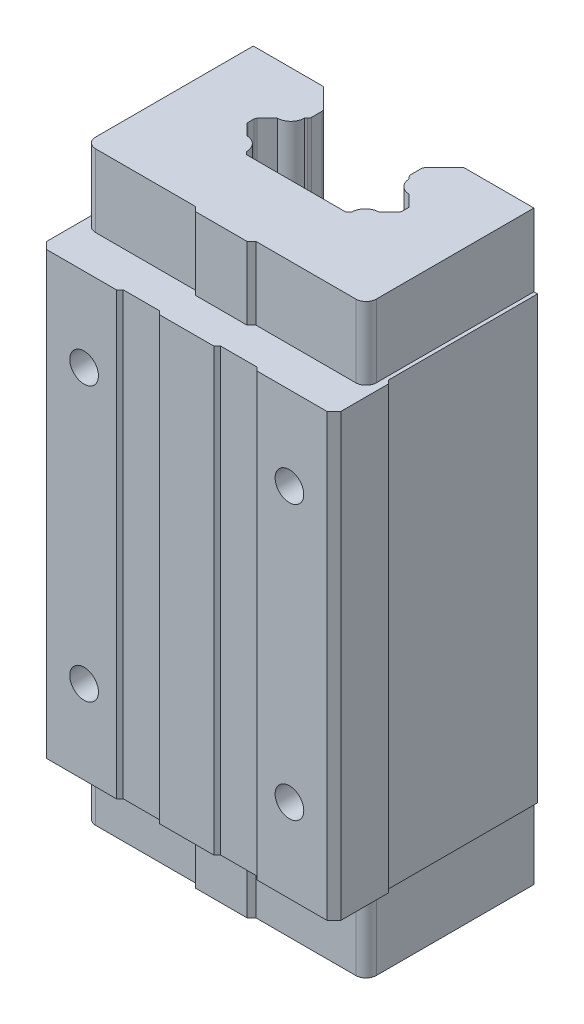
ISO-10303-21;
HEADER;
FILE_DESCRIPTION(('STEP AP214'),'2;1');
FILE_NAME('part.step','',(''),(''),'','','');
FILE_SCHEMA(('AUTOMOTIVE_DESIGN { 1 0 10303 214 1 1 1 1 }'));
ENDSEC;
DATA;
#1=APPLICATION_CONTEXT('core data for automotive mechanical design processes');
#2=APPLICATION_PROTOCOL_DEFINITION('international standard','automotive_design',2000,#1);
#3=PRODUCT_CONTEXT('',#1,'mechanical');
#4=PRODUCT('Part','Part','',(#3));
#5=PRODUCT_RELATED_PRODUCT_CATEGORY('part','',(#4));
#6=PRODUCT_DEFINITION_FORMATION('','',#4);
#7=PRODUCT_DEFINITION_CONTEXT('part definition',#1,'design');
#8=PRODUCT_DEFINITION('design','',#6,#7);
#9=PRODUCT_DEFINITION_SHAPE('','',#8);
#10=(LENGTH_UNIT() NAMED_UNIT(*) SI_UNIT(.MILLI.,.METRE.));
#11=(NAMED_UNIT(*) PLANE_ANGLE_UNIT() SI_UNIT($,.RADIAN.));
#12=(NAMED_UNIT(*) SI_UNIT($,.STERADIAN.) SOLID_ANGLE_UNIT());
#13=UNCERTAINTY_MEASURE_WITH_UNIT(LENGTH_MEASURE(1.E-05),#10,'distance_accuracy_value','');
#14=(GEOMETRIC_REPRESENTATION_CONTEXT(3) GLOBAL_UNCERTAINTY_ASSIGNED_CONTEXT((#13)) GLOBAL_UNIT_ASSIGNED_CONTEXT((#10,
#11,#12)) REPRESENTATION_CONTEXT('',''));
#15=CARTESIAN_POINT('',(0.,0.,0.));
#16=DIRECTION('',(0.,0.,1.));
#17=DIRECTION('',(1.,0.,0.));
#18=AXIS2_PLACEMENT_3D('',#15,#16,#17);
#19=CARTESIAN_POINT('',(0.,64.4,0.));
#20=DIRECTION('',(0.,1.,0.));
#21=DIRECTION('',(1.,0.,0.));
#22=AXIS2_PLACEMENT_3D('',#19,#20,#21);
#23=PLANE('',#22);
#24=DIRECTION('',(0.,0.,-1.));
#25=VECTOR('',#24,1.);
#26=CARTESIAN_POINT('',(40.94270697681,64.4,-14.44458297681));
#27=LINE('',#26,#25);
#28=CARTESIAN_POINT('',(40.94270697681,64.4,-14.44458297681));
#29=VERTEX_POINT('',#28);
#30=CARTESIAN_POINT('',(40.94270697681,64.4,-60.5));
#31=VERTEX_POINT('',#30);
#32=EDGE_CURVE('E961',#29,#31,#27,.T.);
#33=ORIENTED_EDGE('',*,*,#32,.F.);
#34=CARTESIAN_POINT('',(37.94270697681,64.4,-14.44458297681));
#35=DIRECTION('',(0.,1.,0.));
#36=DIRECTION('',(-1.,0.,0.));
#37=AXIS2_PLACEMENT_3D('',#34,#35,#36);
#38=CIRCLE('',#37,3.);
#39=CARTESIAN_POINT('',(37.94270697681,64.4,-11.44458297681));
#40=VERTEX_POINT('',#39);
#41=EDGE_CURVE('E41',#40,#29,#38,.T.);
#42=ORIENTED_EDGE('',*,*,#41,.F.);
#43=DIRECTION('',(1.,0.,0.));
#44=VECTOR('',#43,1.);
#45=CARTESIAN_POINT('',(8.74270697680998,64.4,-11.44458297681));
#46=LINE('',#45,#44);
#47=CARTESIAN_POINT('',(8.74270697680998,64.4,-11.44458297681));
#48=VERTEX_POINT('',#47);
#49=EDGE_CURVE('E1013',#48,#40,#46,.T.);
#50=ORIENTED_EDGE('',*,*,#49,.F.);
#51=DIRECTION('',(0.707106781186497,0.,-0.707106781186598));
#52=VECTOR('',#51,1.);
#53=CARTESIAN_POINT('',(7.44270697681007,64.4,-10.1445829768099));
#54=LINE('',#53,#52);
#55=CARTESIAN_POINT('',(7.44270697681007,64.4,-10.1445829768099));
#56=VERTEX_POINT('',#55);
#57=EDGE_CURVE('E894',#56,#48,#54,.T.);
#58=ORIENTED_EDGE('',*,*,#57,.F.);
#59=DIRECTION('',(1.,0.,0.));
#60=VECTOR('',#59,1.);
#61=CARTESIAN_POINT('',(-7.55729302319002,64.4,-10.14458297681));
#62=LINE('',#61,#60);
#63=CARTESIAN_POINT('',(-7.55729302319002,64.4,-10.14458297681));
#64=VERTEX_POINT('',#63);
#65=EDGE_CURVE('E680',#64,#56,#62,.T.);
#66=ORIENTED_EDGE('',*,*,#65,.F.);
#67=DIRECTION('',(0.707106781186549,0.,0.707106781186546));
#68=VECTOR('',#67,1.);
#69=CARTESIAN_POINT('',(-8.85729302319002,64.4,-11.44458297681));
#70=LINE('',#69,#68);
#71=CARTESIAN_POINT('',(-8.85729302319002,64.4,-11.44458297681));
#72=VERTEX_POINT('',#71);
#73=EDGE_CURVE('E679',#72,#64,#70,.T.);
#74=ORIENTED_EDGE('',*,*,#73,.F.);
#75=DIRECTION('',(1.,0.,0.));
#76=VECTOR('',#75,1.);
#77=CARTESIAN_POINT('',(-38.05729302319,64.4,-11.44458297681));
#78=LINE('',#77,#76);
#79=CARTESIAN_POINT('',(-38.05729302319,64.4,-11.44458297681));
#80=VERTEX_POINT('',#79);
#81=EDGE_CURVE('E820',#80,#72,#78,.T.);
#82=ORIENTED_EDGE('',*,*,#81,.F.);
#83=CARTESIAN_POINT('',(-38.05729302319,64.4,-14.44458297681));
#84=DIRECTION('',(0.,1.,0.));
#85=DIRECTION('',(1.,0.,0.));
#86=AXIS2_PLACEMENT_3D('',#83,#84,#85);
#87=CIRCLE('',#86,3.);
#88=CARTESIAN_POINT('',(-41.05729302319,64.4,-14.44458297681));
#89=VERTEX_POINT('',#88);
#90=EDGE_CURVE('E738',#89,#80,#87,.T.);
#91=ORIENTED_EDGE('',*,*,#90,.F.);
#92=DIRECTION('',(0.,0.,1.));
#93=VECTOR('',#92,1.);
#94=CARTESIAN_POINT('',(-41.05729302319,64.4,-60.5));
#95=LINE('',#94,#93);
#96=CARTESIAN_POINT('',(-41.05729302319,64.4,-60.5));
#97=VERTEX_POINT('',#96);
#98=EDGE_CURVE('E737',#97,#89,#95,.T.);
#99=ORIENTED_EDGE('',*,*,#98,.F.);
#100=DIRECTION('',(1.,0.,0.));
#101=VECTOR('',#100,1.);
#102=CARTESIAN_POINT('',(0.,64.4,-60.5));
#103=LINE('',#102,#101);
#104=CARTESIAN_POINT('',(-42.,64.4,-60.5));
#105=VERTEX_POINT('',#104);
#106=EDGE_CURVE('E1050',#105,#97,#103,.T.);
#107=ORIENTED_EDGE('',*,*,#106,.F.);
#108=DIRECTION('',(0.,0.,-1.));
#109=VECTOR('',#108,1.);
#110=CARTESIAN_POINT('',(-42.,64.4,0.));
#111=LINE('',#110,#109);
#112=CARTESIAN_POINT('',(-42.,64.4,-32.));
#113=VERTEX_POINT('',#112);
#114=EDGE_CURVE('E991',#113,#105,#111,.T.);
#115=ORIENTED_EDGE('',*,*,#114,.F.);
#116=DIRECTION('',(0.70710678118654,0.,-0.707106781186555));
#117=VECTOR('',#116,1.);
#118=CARTESIAN_POINT('',(-37.0000000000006,64.4,-37.));
#119=LINE('',#118,#117);
#120=CARTESIAN_POINT('',(-43.,64.4,-31.));
#121=VERTEX_POINT('',#120);
#122=EDGE_CURVE('E1123',#121,#113,#119,.T.);
#123=ORIENTED_EDGE('',*,*,#122,.F.);
#124=DIRECTION('',(0.,0.,-1.));
#125=VECTOR('',#124,1.);
#126=CARTESIAN_POINT('',(-43.,64.4,0.));
#127=LINE('',#126,#125);
#128=CARTESIAN_POINT('',(-43.,64.4,-2.));
#129=VERTEX_POINT('',#128);
#130=EDGE_CURVE('E592',#129,#121,#127,.T.);
#131=ORIENTED_EDGE('',*,*,#130,.F.);
#132=DIRECTION('',(-0.707106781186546,0.,-0.707106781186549));
#133=VECTOR('',#132,1.);
#134=CARTESIAN_POINT('',(-20.5,64.4,20.5));
#135=LINE('',#134,#133);
#136=CARTESIAN_POINT('',(-41.,64.4,0.));
#137=VERTEX_POINT('',#136);
#138=EDGE_CURVE('E587',#137,#129,#135,.T.);
#139=ORIENTED_EDGE('',*,*,#138,.F.);
#140=DIRECTION('',(1.,0.,0.));
#141=VECTOR('',#140,1.);
#142=CARTESIAN_POINT('',(-65.,64.4,0.));
#143=LINE('',#142,#141);
#144=CARTESIAN_POINT('',(-20.5757359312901,64.4,0.));
#145=VERTEX_POINT('',#144);
#146=EDGE_CURVE('E10',#137,#145,#143,.T.);
#147=ORIENTED_EDGE('',*,*,#146,.T.);
#148=DIRECTION('',(-0.707106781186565,0.,0.70710678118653));
#149=VECTOR('',#148,1.);
#150=CARTESIAN_POINT('',(-10.2878679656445,64.4,-10.287867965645));
#151=LINE('',#150,#149);
#152=CARTESIAN_POINT('',(-19.57573593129,64.4,-1.));
#153=VERTEX_POINT('',#152);
#154=EDGE_CURVE('E851',#153,#145,#151,.T.);
#155=ORIENTED_EDGE('',*,*,#154,.F.);
#156=DIRECTION('',(-1.,0.,0.));
#157=VECTOR('',#156,1.);
#158=CARTESIAN_POINT('',(0.,64.4,-1.));
#159=LINE('',#158,#157);
#160=CARTESIAN_POINT('',(-8.92426406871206,64.4,-1.));
#161=VERTEX_POINT('',#160);
#162=EDGE_CURVE('E732',#161,#153,#159,.T.);
#163=ORIENTED_EDGE('',*,*,#162,.F.);
#164=DIRECTION('',(-0.707106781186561,0.,-0.707106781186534));
#165=VECTOR('',#164,1.);
#166=CARTESIAN_POINT('',(-3.96213203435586,64.4,3.96213203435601));
#167=LINE('',#166,#165);
#168=CARTESIAN_POINT('',(-7.92426406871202,64.4,0.));
#169=VERTEX_POINT('',#168);
#170=EDGE_CURVE('E861',#169,#161,#167,.T.);
#171=ORIENTED_EDGE('',*,*,#170,.F.);
#172=DIRECTION('',(1.,0.,0.));
#173=VECTOR('',#172,1.);
#174=CARTESIAN_POINT('',(-65.,64.4,0.));
#175=LINE('',#174,#173);
#176=CARTESIAN_POINT('',(7.924264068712,64.4,0.));
#177=VERTEX_POINT('',#176);
#178=EDGE_CURVE('E27',#169,#177,#175,.T.);
#179=ORIENTED_EDGE('',*,*,#178,.T.);
#180=DIRECTION('',(-0.707106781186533,0.,0.707106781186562));
#181=VECTOR('',#180,1.);
#182=CARTESIAN_POINT('',(3.96213203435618,64.4,3.96213203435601));
#183=LINE('',#182,#181);
#184=CARTESIAN_POINT('',(8.92426406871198,64.4,-1.));
#185=VERTEX_POINT('',#184);
#186=EDGE_CURVE('E910',#185,#177,#183,.T.);
#187=ORIENTED_EDGE('',*,*,#186,.F.);
#188=DIRECTION('',(-1.,0.,0.));
#189=VECTOR('',#188,1.);
#190=CARTESIAN_POINT('',(0.,64.4,-1.));
#191=LINE('',#190,#189);
#192=CARTESIAN_POINT('',(19.57573593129,64.4,-1.));
#193=VERTEX_POINT('',#192);
#194=EDGE_CURVE('E669',#193,#185,#191,.T.);
#195=ORIENTED_EDGE('',*,*,#194,.F.);
#196=DIRECTION('',(-0.707106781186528,0.,-0.707106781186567));
#197=VECTOR('',#196,1.);
#198=CARTESIAN_POINT('',(10.2878679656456,64.4,-10.287867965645));
#199=LINE('',#198,#197);
#200=CARTESIAN_POINT('',(20.57573593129,64.4,0.));
#201=VERTEX_POINT('',#200);
#202=EDGE_CURVE('E710',#201,#193,#199,.T.);
#203=ORIENTED_EDGE('',*,*,#202,.F.);
#204=DIRECTION('',(1.,0.,0.));
#205=VECTOR('',#204,1.);
#206=CARTESIAN_POINT('',(-65.,64.4,0.));
#207=LINE('',#206,#205);
#208=CARTESIAN_POINT('',(41.,64.4,0.));
#209=VERTEX_POINT('',#208);
#210=EDGE_CURVE('E686',#201,#209,#207,.T.);
#211=ORIENTED_EDGE('',*,*,#210,.T.);
#212=DIRECTION('',(-0.707106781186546,0.,0.707106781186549));
#213=VECTOR('',#212,1.);
#214=CARTESIAN_POINT('',(20.5,64.4,20.5));
#215=LINE('',#214,#213);
#216=CARTESIAN_POINT('',(43.,64.4,-2.));
#217=VERTEX_POINT('',#216);
#218=EDGE_CURVE('E1040',#217,#209,#215,.T.);
#219=ORIENTED_EDGE('',*,*,#218,.F.);
#220=DIRECTION('',(0.,0.,1.));
#221=VECTOR('',#220,1.);
#222=CARTESIAN_POINT('',(43.,64.4,0.));
#223=LINE('',#222,#221);
#224=CARTESIAN_POINT('',(43.,64.4,-16.));
#225=VERTEX_POINT('',#224);
#226=EDGE_CURVE('E956',#225,#217,#223,.T.);
#227=ORIENTED_EDGE('',*,*,#226,.F.);
#228=DIRECTION('',(0.707106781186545,0.,0.70710678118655));
#229=VECTOR('',#228,1.);
#230=CARTESIAN_POINT('',(29.5,64.4,-29.5));
#231=LINE('',#230,#229);
#232=CARTESIAN_POINT('',(42.,64.4,-17.));
#233=VERTEX_POINT('',#232);
#234=EDGE_CURVE('E750',#233,#225,#231,.T.);
#235=ORIENTED_EDGE('',*,*,#234,.F.);
#236=DIRECTION('',(0.,0.,1.));
#237=VECTOR('',#236,1.);
#238=CARTESIAN_POINT('',(42.,64.4,0.));
#239=LINE('',#238,#237);
#240=CARTESIAN_POINT('',(42.,64.4,-60.5));
#241=VERTEX_POINT('',#240);
#242=EDGE_CURVE('E776',#241,#233,#239,.T.);
#243=ORIENTED_EDGE('',*,*,#242,.F.);
#244=DIRECTION('',(1.,0.,-2.34957744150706E-13));
#245=VECTOR('',#244,1.);
#246=CARTESIAN_POINT('',(-1.42149435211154E-11,64.4,-60.4999999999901));
#247=LINE('',#246,#245);
#248=EDGE_CURVE('E978',#31,#241,#247,.T.);
#249=ORIENTED_EDGE('',*,*,#248,.F.);
#250=EDGE_LOOP('',(#33,#42,#50,#58,#66,#74,#82,#91,#99,#107,#115,#123,#131,#139,#147,#155,#163,
#171,#179,#187,#195,#203,#211,#219,#227,#235,#243,#249));
#251=FACE_BOUND('',#250,.T.);
#252=ADVANCED_FACE('F16',(#251),#23,.T.);
#253=CARTESIAN_POINT('',(-65.,-64.4,0.));
#254=DIRECTION('',(0.,0.,1.));
#255=DIRECTION('',(1.,0.,0.));
#256=AXIS2_PLACEMENT_3D('',#253,#254,#255);
#257=PLANE('',#256);
#258=CARTESIAN_POINT('',(-30.,40.,0.));
#259=DIRECTION('',(0.,0.,-1.));
#260=DIRECTION('',(0.,-1.,0.));
#261=AXIS2_PLACEMENT_3D('',#258,#259,#260);
#262=CIRCLE('',#261,4.188);
#263=CARTESIAN_POINT('',(-30.,35.812,0.));
#264=VERTEX_POINT('',#263);
#265=EDGE_CURVE('E690',#264,#264,#262,.T.);
#266=ORIENTED_EDGE('',*,*,#265,.T.);
#267=EDGE_LOOP('',(#266));
#268=FACE_BOUND('',#267,.T.);
#269=CARTESIAN_POINT('',(-30.,-40.,0.));
#270=DIRECTION('',(0.,0.,-1.));
#271=DIRECTION('',(0.,-1.,0.));
#272=AXIS2_PLACEMENT_3D('',#269,#270,#271);
#273=CIRCLE('',#272,4.188);
#274=CARTESIAN_POINT('',(-30.,-44.188,0.));
#275=VERTEX_POINT('',#274);
#276=EDGE_CURVE('E717',#275,#275,#273,.T.);
#277=ORIENTED_EDGE('',*,*,#276,.T.);
#278=EDGE_LOOP('',(#277));
#279=FACE_BOUND('',#278,.T.);
#280=DIRECTION('',(0.,1.,0.));
#281=VECTOR('',#280,1.);
#282=CARTESIAN_POINT('',(-20.5757359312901,-199.723408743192,0.));
#283=LINE('',#282,#281);
#284=CARTESIAN_POINT('',(-20.5757359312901,-64.4,0.));
#285=VERTEX_POINT('',#284);
#286=EDGE_CURVE('E605',#285,#145,#283,.T.);
#287=ORIENTED_EDGE('',*,*,#286,.T.);
#288=ORIENTED_EDGE('',*,*,#146,.F.);
#289=DIRECTION('',(0.,1.,0.));
#290=VECTOR('',#289,1.);
#291=CARTESIAN_POINT('',(-41.,-199.723408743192,0.));
#292=LINE('',#291,#290);
#293=CARTESIAN_POINT('',(-41.,-64.4,0.));
#294=VERTEX_POINT('',#293);
#295=EDGE_CURVE('E598',#294,#137,#292,.T.);
#296=ORIENTED_EDGE('',*,*,#295,.F.);
#297=DIRECTION('',(1.,0.,0.));
#298=VECTOR('',#297,1.);
#299=CARTESIAN_POINT('',(-65.,-64.4,0.));
#300=LINE('',#299,#298);
#301=EDGE_CURVE('E909',#294,#285,#300,.T.);
#302=ORIENTED_EDGE('',*,*,#301,.T.);
#303=EDGE_LOOP('',(#287,#288,#296,#302));
#304=FACE_BOUND('',#303,.T.);
#305=ADVANCED_FACE('F602',(#268,#279,#304),#257,.T.);
#306=CARTESIAN_POINT('',(-65.,-64.4,0.));
#307=DIRECTION('',(0.,0.,1.));
#308=DIRECTION('',(1.,0.,0.));
#309=AXIS2_PLACEMENT_3D('',#306,#307,#308);
#310=PLANE('',#309);
#311=DIRECTION('',(0.,1.,0.));
#312=VECTOR('',#311,1.);
#313=CARTESIAN_POINT('',(7.92426406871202,-199.723408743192,0.));
#314=LINE('',#313,#312);
#315=CARTESIAN_POINT('',(7.92426406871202,-64.4,0.));
#316=VERTEX_POINT('',#315);
#317=EDGE_CURVE('E824',#316,#177,#314,.T.);
#318=ORIENTED_EDGE('',*,*,#317,.T.);
#319=ORIENTED_EDGE('',*,*,#178,.F.);
#320=DIRECTION('',(0.,1.,0.));
#321=VECTOR('',#320,1.);
#322=CARTESIAN_POINT('',(-7.92426406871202,-199.723408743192,0.));
#323=LINE('',#322,#321);
#324=CARTESIAN_POINT('',(-7.92426406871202,-64.4,0.));
#325=VERTEX_POINT('',#324);
#326=EDGE_CURVE('E856',#325,#169,#323,.T.);
#327=ORIENTED_EDGE('',*,*,#326,.F.);
#328=DIRECTION('',(1.,0.,0.));
#329=VECTOR('',#328,1.);
#330=CARTESIAN_POINT('',(-65.,-64.4,0.));
#331=LINE('',#330,#329);
#332=EDGE_CURVE('E821',#325,#316,#331,.T.);
#333=ORIENTED_EDGE('',*,*,#332,.T.);
#334=EDGE_LOOP('',(#318,#319,#327,#333));
#335=FACE_BOUND('',#334,.T.);
#336=ADVANCED_FACE('F18',(#335),#310,.T.);
#337=CARTESIAN_POINT('',(-65.,-64.4,0.));
#338=DIRECTION('',(0.,0.,1.));
#339=DIRECTION('',(1.,0.,0.));
#340=AXIS2_PLACEMENT_3D('',#337,#338,#339);
#341=PLANE('',#340);
#342=CARTESIAN_POINT('',(30.,40.,0.));
#343=DIRECTION('',(0.,0.,-1.));
#344=DIRECTION('',(0.,-1.,0.));
#345=AXIS2_PLACEMENT_3D('',#342,#343,#344);
#346=CIRCLE('',#345,4.188);
#347=CARTESIAN_POINT('',(30.,35.812,0.));
#348=VERTEX_POINT('',#347);
#349=EDGE_CURVE('E825',#348,#348,#346,.T.);
#350=ORIENTED_EDGE('',*,*,#349,.T.);
#351=EDGE_LOOP('',(#350));
#352=FACE_BOUND('',#351,.T.);
#353=CARTESIAN_POINT('',(30.,-40.,0.));
#354=DIRECTION('',(0.,0.,-1.));
#355=DIRECTION('',(0.,-1.,0.));
#356=AXIS2_PLACEMENT_3D('',#353,#354,#355);
#357=CIRCLE('',#356,4.188);
#358=CARTESIAN_POINT('',(30.,-44.188,0.));
#359=VERTEX_POINT('',#358);
#360=EDGE_CURVE('E840',#359,#359,#357,.T.);
#361=ORIENTED_EDGE('',*,*,#360,.T.);
#362=EDGE_LOOP('',(#361));
#363=FACE_BOUND('',#362,.T.);
#364=DIRECTION('',(0.,1.,0.));
#365=VECTOR('',#364,1.);
#366=CARTESIAN_POINT('',(41.,-199.723408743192,0.));
#367=LINE('',#366,#365);
#368=CARTESIAN_POINT('',(41.,-64.4,0.));
#369=VERTEX_POINT('',#368);
#370=EDGE_CURVE('E836',#369,#209,#367,.T.);
#371=ORIENTED_EDGE('',*,*,#370,.T.);
#372=ORIENTED_EDGE('',*,*,#210,.F.);
#373=DIRECTION('',(0.,1.,0.));
#374=VECTOR('',#373,1.);
#375=CARTESIAN_POINT('',(20.57573593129,-199.723408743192,0.));
#376=LINE('',#375,#374);
#377=CARTESIAN_POINT('',(20.57573593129,-64.4,0.));
#378=VERTEX_POINT('',#377);
#379=EDGE_CURVE('E670',#378,#201,#376,.T.);
#380=ORIENTED_EDGE('',*,*,#379,.F.);
#381=DIRECTION('',(1.,0.,0.));
#382=VECTOR('',#381,1.);
#383=CARTESIAN_POINT('',(-65.,-64.4,0.));
#384=LINE('',#383,#382);
#385=EDGE_CURVE('E616',#378,#369,#384,.T.);
#386=ORIENTED_EDGE('',*,*,#385,.T.);
#387=EDGE_LOOP('',(#371,#372,#380,#386));
#388=FACE_BOUND('',#387,.T.);
#389=ADVANCED_FACE('F1619',(#352,#363,#388),#341,.T.);
#390=CARTESIAN_POINT('',(0.,-64.4,0.));
#391=DIRECTION('',(0.,1.,0.));
#392=DIRECTION('',(1.,0.,0.));
#393=AXIS2_PLACEMENT_3D('',#390,#391,#392);
#394=PLANE('',#393);
#395=DIRECTION('',(0.,0.,-1.));
#396=VECTOR('',#395,1.);
#397=CARTESIAN_POINT('',(-41.05729302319,-64.4,-14.44458297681));
#398=LINE('',#397,#396);
#399=CARTESIAN_POINT('',(-41.05729302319,-64.4,-14.44458297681));
#400=VERTEX_POINT('',#399);
#401=CARTESIAN_POINT('',(-41.05729302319,-64.4,-60.5));
#402=VERTEX_POINT('',#401);
#403=EDGE_CURVE('E20',#400,#402,#398,.T.);
#404=ORIENTED_EDGE('',*,*,#403,.F.);
#405=CARTESIAN_POINT('',(-38.05729302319,-64.4,-14.44458297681));
#406=DIRECTION('',(0.,-1.,0.));
#407=DIRECTION('',(1.,0.,0.));
#408=AXIS2_PLACEMENT_3D('',#405,#406,#407);
#409=CIRCLE('',#408,3.);
#410=CARTESIAN_POINT('',(-38.05729302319,-64.4,-11.44458297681));
#411=VERTEX_POINT('',#410);
#412=EDGE_CURVE('E685',#411,#400,#409,.T.);
#413=ORIENTED_EDGE('',*,*,#412,.F.);
#414=DIRECTION('',(-1.,0.,0.));
#415=VECTOR('',#414,1.);
#416=CARTESIAN_POINT('',(-8.85729302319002,-64.4,-11.44458297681));
#417=LINE('',#416,#415);
#418=CARTESIAN_POINT('',(-8.85729302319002,-64.4,-11.44458297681));
#419=VERTEX_POINT('',#418);
#420=EDGE_CURVE('E1024',#419,#411,#417,.T.);
#421=ORIENTED_EDGE('',*,*,#420,.F.);
#422=DIRECTION('',(-0.707106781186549,0.,-0.707106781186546));
#423=VECTOR('',#422,1.);
#424=CARTESIAN_POINT('',(-7.55729302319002,-64.4,-10.14458297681));
#425=LINE('',#424,#423);
#426=CARTESIAN_POINT('',(-7.55729302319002,-64.4,-10.14458297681));
#427=VERTEX_POINT('',#426);
#428=EDGE_CURVE('E949',#427,#419,#425,.T.);
#429=ORIENTED_EDGE('',*,*,#428,.F.);
#430=DIRECTION('',(-1.,0.,0.));
#431=VECTOR('',#430,1.);
#432=CARTESIAN_POINT('',(7.44270697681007,-64.4,-10.1445829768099));
#433=LINE('',#432,#431);
#434=CARTESIAN_POINT('',(7.44270697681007,-64.4,-10.1445829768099));
#435=VERTEX_POINT('',#434);
#436=EDGE_CURVE('E691',#435,#427,#433,.T.);
#437=ORIENTED_EDGE('',*,*,#436,.F.);
#438=DIRECTION('',(-0.707106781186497,0.,0.707106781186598));
#439=VECTOR('',#438,1.);
#440=CARTESIAN_POINT('',(8.74270697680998,-64.4,-11.44458297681));
#441=LINE('',#440,#439);
#442=CARTESIAN_POINT('',(8.74270697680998,-64.4,-11.44458297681));
#443=VERTEX_POINT('',#442);
#444=EDGE_CURVE('E1005',#443,#435,#441,.T.);
#445=ORIENTED_EDGE('',*,*,#444,.F.);
#446=DIRECTION('',(-1.,0.,0.));
#447=VECTOR('',#446,1.);
#448=CARTESIAN_POINT('',(37.94270697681,-64.4,-11.44458297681));
#449=LINE('',#448,#447);
#450=CARTESIAN_POINT('',(37.94270697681,-64.4,-11.44458297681));
#451=VERTEX_POINT('',#450);
#452=EDGE_CURVE('E749',#451,#443,#449,.T.);
#453=ORIENTED_EDGE('',*,*,#452,.F.);
#454=CARTESIAN_POINT('',(37.94270697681,-64.4,-14.44458297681));
#455=DIRECTION('',(0.,-1.,0.));
#456=DIRECTION('',(1.,0.,0.));
#457=AXIS2_PLACEMENT_3D('',#454,#455,#456);
#458=CIRCLE('',#457,3.);
#459=CARTESIAN_POINT('',(40.94270697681,-64.4,-14.44458297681));
#460=VERTEX_POINT('',#459);
#461=EDGE_CURVE('E748',#460,#451,#458,.T.);
#462=ORIENTED_EDGE('',*,*,#461,.F.);
#463=DIRECTION('',(0.,0.,1.));
#464=VECTOR('',#463,1.);
#465=CARTESIAN_POINT('',(40.94270697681,-64.4,-60.5));
#466=LINE('',#465,#464);
#467=CARTESIAN_POINT('',(40.94270697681,-64.4,-60.5));
#468=VERTEX_POINT('',#467);
#469=EDGE_CURVE('E873',#468,#460,#466,.T.);
#470=ORIENTED_EDGE('',*,*,#469,.F.);
#471=DIRECTION('',(-1.,0.,2.34957744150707E-13));
#472=VECTOR('',#471,1.);
#473=CARTESIAN_POINT('',(-1.42149435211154E-11,-64.4,-60.4999999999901));
#474=LINE('',#473,#472);
#475=CARTESIAN_POINT('',(42.,-64.4,-60.5));
#476=VERTEX_POINT('',#475);
#477=EDGE_CURVE('E1056',#476,#468,#474,.T.);
#478=ORIENTED_EDGE('',*,*,#477,.F.);
#479=DIRECTION('',(0.,0.,-1.));
#480=VECTOR('',#479,1.);
#481=CARTESIAN_POINT('',(42.,-64.4,0.));
#482=LINE('',#481,#480);
#483=CARTESIAN_POINT('',(42.,-64.4,-17.));
#484=VERTEX_POINT('',#483);
#485=EDGE_CURVE('E753',#484,#476,#482,.T.);
#486=ORIENTED_EDGE('',*,*,#485,.F.);
#487=DIRECTION('',(-0.707106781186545,0.,-0.70710678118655));
#488=VECTOR('',#487,1.);
#489=CARTESIAN_POINT('',(29.5,-64.4,-29.5));
#490=LINE('',#489,#488);
#491=CARTESIAN_POINT('',(43.,-64.4,-16.));
#492=VERTEX_POINT('',#491);
#493=EDGE_CURVE('E762',#492,#484,#490,.T.);
#494=ORIENTED_EDGE('',*,*,#493,.F.);
#495=DIRECTION('',(0.,0.,-1.));
#496=VECTOR('',#495,1.);
#497=CARTESIAN_POINT('',(43.,-64.4,0.));
#498=LINE('',#497,#496);
#499=CARTESIAN_POINT('',(43.,-64.4,-2.));
#500=VERTEX_POINT('',#499);
#501=EDGE_CURVE('E635',#500,#492,#498,.T.);
#502=ORIENTED_EDGE('',*,*,#501,.F.);
#503=DIRECTION('',(0.707106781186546,0.,-0.707106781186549));
#504=VECTOR('',#503,1.);
#505=CARTESIAN_POINT('',(20.5,-64.4,20.5));
#506=LINE('',#505,#504);
#507=EDGE_CURVE('E599',#369,#500,#506,.T.);
#508=ORIENTED_EDGE('',*,*,#507,.F.);
#509=ORIENTED_EDGE('',*,*,#385,.F.);
#510=DIRECTION('',(0.707106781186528,0.,0.707106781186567));
#511=VECTOR('',#510,1.);
#512=CARTESIAN_POINT('',(10.2878679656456,-64.4,-10.287867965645));
#513=LINE('',#512,#511);
#514=CARTESIAN_POINT('',(19.57573593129,-64.4,-1.));
#515=VERTEX_POINT('',#514);
#516=EDGE_CURVE('E665',#515,#378,#513,.T.);
#517=ORIENTED_EDGE('',*,*,#516,.F.);
#518=DIRECTION('',(1.,0.,0.));
#519=VECTOR('',#518,1.);
#520=CARTESIAN_POINT('',(0.,-64.4,-1.));
#521=LINE('',#520,#519);
#522=CARTESIAN_POINT('',(8.92426406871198,-64.4,-1.));
#523=VERTEX_POINT('',#522);
#524=EDGE_CURVE('E706',#523,#515,#521,.T.);
#525=ORIENTED_EDGE('',*,*,#524,.F.);
#526=DIRECTION('',(0.707106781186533,0.,-0.707106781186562));
#527=VECTOR('',#526,1.);
#528=CARTESIAN_POINT('',(3.96213203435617,-64.4,3.96213203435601));
#529=LINE('',#528,#527);
#530=EDGE_CURVE('E620',#316,#523,#529,.T.);
#531=ORIENTED_EDGE('',*,*,#530,.F.);
#532=ORIENTED_EDGE('',*,*,#332,.F.);
#533=DIRECTION('',(0.707106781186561,0.,0.707106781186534));
#534=VECTOR('',#533,1.);
#535=CARTESIAN_POINT('',(-3.96213203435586,-64.4,3.96213203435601));
#536=LINE('',#535,#534);
#537=CARTESIAN_POINT('',(-8.92426406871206,-64.4,-1.));
#538=VERTEX_POINT('',#537);
#539=EDGE_CURVE('E860',#538,#325,#536,.T.);
#540=ORIENTED_EDGE('',*,*,#539,.F.);
#541=DIRECTION('',(1.,0.,0.));
#542=VECTOR('',#541,1.);
#543=CARTESIAN_POINT('',(0.,-64.4,-1.));
#544=LINE('',#543,#542);
#545=CARTESIAN_POINT('',(-19.57573593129,-64.4,-1.));
#546=VERTEX_POINT('',#545);
#547=EDGE_CURVE('E731',#546,#538,#544,.T.);
#548=ORIENTED_EDGE('',*,*,#547,.F.);
#549=DIRECTION('',(0.707106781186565,0.,-0.70710678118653));
#550=VECTOR('',#549,1.);
#551=CARTESIAN_POINT('',(-10.2878679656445,-64.4,-10.287867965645));
#552=LINE('',#551,#550);
#553=EDGE_CURVE('E1019',#285,#546,#552,.T.);
#554=ORIENTED_EDGE('',*,*,#553,.F.);
#555=ORIENTED_EDGE('',*,*,#301,.F.);
#556=DIRECTION('',(0.707106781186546,0.,0.707106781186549));
#557=VECTOR('',#556,1.);
#558=CARTESIAN_POINT('',(-20.5,-64.4,20.5));
#559=LINE('',#558,#557);
#560=CARTESIAN_POINT('',(-43.,-64.4,-2.));
#561=VERTEX_POINT('',#560);
#562=EDGE_CURVE('E609',#561,#294,#559,.T.);
#563=ORIENTED_EDGE('',*,*,#562,.F.);
#564=DIRECTION('',(0.,0.,1.));
#565=VECTOR('',#564,1.);
#566=CARTESIAN_POINT('',(-43.,-64.4,0.));
#567=LINE('',#566,#565);
#568=CARTESIAN_POINT('',(-43.,-64.4,-31.));
#569=VERTEX_POINT('',#568);
#570=EDGE_CURVE('E1234',#569,#561,#567,.T.);
#571=ORIENTED_EDGE('',*,*,#570,.F.);
#572=DIRECTION('',(-0.70710678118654,0.,0.707106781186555));
#573=VECTOR('',#572,1.);
#574=CARTESIAN_POINT('',(-37.0000000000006,-64.4,-37.));
#575=LINE('',#574,#573);
#576=CARTESIAN_POINT('',(-42.,-64.4,-32.));
#577=VERTEX_POINT('',#576);
#578=EDGE_CURVE('E987',#577,#569,#575,.T.);
#579=ORIENTED_EDGE('',*,*,#578,.F.);
#580=DIRECTION('',(0.,0.,1.));
#581=VECTOR('',#580,1.);
#582=CARTESIAN_POINT('',(-42.,-64.4,0.));
#583=LINE('',#582,#581);
#584=CARTESIAN_POINT('',(-42.,-64.4,-60.5));
#585=VERTEX_POINT('',#584);
#586=EDGE_CURVE('E1018',#585,#577,#583,.T.);
#587=ORIENTED_EDGE('',*,*,#586,.F.);
#588=DIRECTION('',(-1.,0.,0.));
#589=VECTOR('',#588,1.);
#590=CARTESIAN_POINT('',(0.,-64.4,-60.5));
#591=LINE('',#590,#589);
#592=EDGE_CURVE('E1082',#402,#585,#591,.T.);
#593=ORIENTED_EDGE('',*,*,#592,.F.);
#594=EDGE_LOOP('',(#404,#413,#421,#429,#437,#445,#453,#462,#470,#478,#486,#494,#502,#508,#509,
#517,#525,#531,#532,#540,#548,#554,#555,#563,#571,#579,#587,#593));
#595=FACE_BOUND('',#594,.T.);
#596=ADVANCED_FACE('F1679',(#595),#394,.F.);
#597=CARTESIAN_POINT('',(-41.,-199.723408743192,0.));
#598=DIRECTION('',(-0.707106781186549,0.,0.707106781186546));
#599=DIRECTION('',(0.,1.,0.));
#600=AXIS2_PLACEMENT_3D('',#597,#598,#599);
#601=PLANE('',#600);
#602=ORIENTED_EDGE('',*,*,#562,.T.);
#603=ORIENTED_EDGE('',*,*,#295,.T.);
#604=ORIENTED_EDGE('',*,*,#138,.T.);
#605=DIRECTION('',(0.,1.,0.));
#606=VECTOR('',#605,1.);
#607=CARTESIAN_POINT('',(-43.,-199.723408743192,-2.));
#608=LINE('',#607,#606);
#609=EDGE_CURVE('E634',#561,#129,#608,.T.);
#610=ORIENTED_EDGE('',*,*,#609,.F.);
#611=EDGE_LOOP('',(#602,#603,#604,#610));
#612=FACE_BOUND('',#611,.T.);
#613=ADVANCED_FACE('F607',(#612),#601,.T.);
#614=CARTESIAN_POINT('',(43.,-199.723408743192,-2.));
#615=DIRECTION('',(0.707106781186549,0.,0.707106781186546));
#616=DIRECTION('',(0.,-1.,0.));
#617=AXIS2_PLACEMENT_3D('',#614,#615,#616);
#618=PLANE('',#617);
#619=ORIENTED_EDGE('',*,*,#507,.T.);
#620=DIRECTION('',(0.,1.,0.));
#621=VECTOR('',#620,1.);
#622=CARTESIAN_POINT('',(43.,-199.723408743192,-2.));
#623=LINE('',#622,#621);
#624=EDGE_CURVE('E1043',#500,#217,#623,.T.);
#625=ORIENTED_EDGE('',*,*,#624,.T.);
#626=ORIENTED_EDGE('',*,*,#218,.T.);
#627=ORIENTED_EDGE('',*,*,#370,.F.);
#628=EDGE_LOOP('',(#619,#625,#626,#627));
#629=FACE_BOUND('',#628,.T.);
#630=ADVANCED_FACE('F1678',(#629),#618,.T.);
#631=CARTESIAN_POINT('',(-15.6999999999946,-199.723408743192,-54.0026171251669));
#632=DIRECTION('',(0.,1.,0.));
#633=DIRECTION('',(0.,0.,1.));
#634=AXIS2_PLACEMENT_3D('',#631,#632,#633);
#635=CYLINDRICAL_SURFACE('',#634,1.2);
#636=DIRECTION('',(0.,1.,0.));
#637=VECTOR('',#636,1.);
#638=CARTESIAN_POINT('',(-14.4999999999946,-199.723408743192,-54.0026171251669));
#639=LINE('',#638,#637);
#640=CARTESIAN_POINT('',(-14.4999999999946,-85.6,-54.0026171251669));
#641=VERTEX_POINT('',#640);
#642=CARTESIAN_POINT('',(-14.4999999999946,85.6,-54.0026171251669));
#643=VERTEX_POINT('',#642);
#644=EDGE_CURVE('E1103',#641,#643,#639,.T.);
#645=ORIENTED_EDGE('',*,*,#644,.F.);
#646=CARTESIAN_POINT('',(-15.6999999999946,-85.6,-54.0026171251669));
#647=DIRECTION('',(0.,-1.,0.));
#648=DIRECTION('',(-1.,0.,0.));
#649=AXIS2_PLACEMENT_3D('',#646,#647,#648);
#650=CIRCLE('',#649,1.2);
#651=CARTESIAN_POINT('',(-14.8514718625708,-85.6,-54.8511452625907));
#652=VERTEX_POINT('',#651);
#653=EDGE_CURVE('E993',#652,#641,#650,.T.);
#654=ORIENTED_EDGE('',*,*,#653,.F.);
#655=DIRECTION('',(0.,1.,0.));
#656=VECTOR('',#655,1.);
#657=CARTESIAN_POINT('',(-14.8514718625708,-199.723408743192,-54.8511452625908));
#658=LINE('',#657,#656);
#659=CARTESIAN_POINT('',(-14.8514718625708,85.6,-54.8511452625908));
#660=VERTEX_POINT('',#659);
#661=EDGE_CURVE('E651',#652,#660,#658,.T.);
#662=ORIENTED_EDGE('',*,*,#661,.T.);
#663=CARTESIAN_POINT('',(-15.6999999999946,85.6,-54.0026171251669));
#664=DIRECTION('',(0.,1.,0.));
#665=DIRECTION('',(1.,0.,0.));
#666=AXIS2_PLACEMENT_3D('',#663,#664,#665);
#667=CIRCLE('',#666,1.2);
#668=EDGE_CURVE('E844',#643,#660,#667,.T.);
#669=ORIENTED_EDGE('',*,*,#668,.F.);
#670=EDGE_LOOP('',(#645,#654,#662,#669));
#671=FACE_BOUND('',#670,.T.);
#672=ADVANCED_FACE('F1358',(#671),#635,.T.);
#673=CARTESIAN_POINT('',(-14.8514718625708,-199.723408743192,-54.8511452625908));
#674=DIRECTION('',(0.707106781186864,0.,-0.707106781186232));
#675=DIRECTION('',(0.,-1.,0.));
#676=AXIS2_PLACEMENT_3D('',#673,#674,#675);
#677=PLANE('',#676);
#678=ORIENTED_EDGE('',*,*,#661,.F.);
#679=DIRECTION('',(0.707106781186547,0.,0.707106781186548));
#680=VECTOR('',#679,1.);
#681=CARTESIAN_POINT('',(-20.500326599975,-85.6,-60.4999999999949));
#682=LINE('',#681,#680);
#683=CARTESIAN_POINT('',(-20.500326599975,-85.6,-60.4999999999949));
#684=VERTEX_POINT('',#683);
#685=EDGE_CURVE('E721',#684,#652,#682,.T.);
#686=ORIENTED_EDGE('',*,*,#685,.F.);
#687=DIRECTION('',(0.,1.,0.));
#688=VECTOR('',#687,1.);
#689=CARTESIAN_POINT('',(-20.500326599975,-199.723408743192,-60.5));
#690=LINE('',#689,#688);
#691=CARTESIAN_POINT('',(-20.500326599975,85.6,-60.4999999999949));
#692=VERTEX_POINT('',#691);
#693=EDGE_CURVE('E647',#684,#692,#690,.T.);
#694=ORIENTED_EDGE('',*,*,#693,.T.);
#695=DIRECTION('',(-0.707106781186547,0.,-0.707106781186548));
#696=VECTOR('',#695,1.);
#697=CARTESIAN_POINT('',(-14.8514718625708,85.6,-54.8511452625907));
#698=LINE('',#697,#696);
#699=EDGE_CURVE('E841',#660,#692,#698,.T.);
#700=ORIENTED_EDGE('',*,*,#699,.F.);
#701=EDGE_LOOP('',(#678,#686,#694,#700));
#702=FACE_BOUND('',#701,.T.);
#703=ADVANCED_FACE('F1360',(#702),#677,.T.);
#704=CARTESIAN_POINT('',(-20.500326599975,-199.723408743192,-60.5));
#705=DIRECTION('',(0.,0.,-1.));
#706=DIRECTION('',(0.,-1.,0.));
#707=AXIS2_PLACEMENT_3D('',#704,#705,#706);
#708=PLANE('',#707);
#709=ORIENTED_EDGE('',*,*,#693,.F.);
#710=DIRECTION('',(1.,0.,2.4573250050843E-13));
#711=VECTOR('',#710,1.);
#712=CARTESIAN_POINT('',(-41.05729302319,-85.6,-60.5));
#713=LINE('',#712,#711);
#714=CARTESIAN_POINT('',(-41.05729302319,-85.6,-60.5));
#715=VERTEX_POINT('',#714);
#716=EDGE_CURVE('E631',#715,#684,#713,.T.);
#717=ORIENTED_EDGE('',*,*,#716,.F.);
#718=DIRECTION('',(0.,1.,0.));
#719=VECTOR('',#718,1.);
#720=CARTESIAN_POINT('',(-41.05729302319,-85.6,-60.5));
#721=LINE('',#720,#719);
#722=EDGE_CURVE('E652',#715,#402,#721,.T.);
#723=ORIENTED_EDGE('',*,*,#722,.T.);
#724=ORIENTED_EDGE('',*,*,#592,.T.);
#725=DIRECTION('',(0.,1.,0.));
#726=VECTOR('',#725,1.);
#727=CARTESIAN_POINT('',(-42.,-199.723408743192,-60.5));
#728=LINE('',#727,#726);
#729=EDGE_CURVE('E1116',#585,#105,#728,.T.);
#730=ORIENTED_EDGE('',*,*,#729,.T.);
#731=ORIENTED_EDGE('',*,*,#106,.T.);
#732=DIRECTION('',(0.,-1.,0.));
#733=VECTOR('',#732,1.);
#734=CARTESIAN_POINT('',(-41.05729302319,85.6,-60.5));
#735=LINE('',#734,#733);
#736=CARTESIAN_POINT('',(-41.05729302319,85.6,-60.5));
#737=VERTEX_POINT('',#736);
#738=EDGE_CURVE('E733',#737,#97,#735,.T.);
#739=ORIENTED_EDGE('',*,*,#738,.F.);
#740=DIRECTION('',(-1.,0.,-2.4573250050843E-13));
#741=VECTOR('',#740,1.);
#742=CARTESIAN_POINT('',(-20.500326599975,85.6,-60.4999999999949));
#743=LINE('',#742,#741);
#744=EDGE_CURVE('E799',#692,#737,#743,.T.);
#745=ORIENTED_EDGE('',*,*,#744,.F.);
#746=EDGE_LOOP('',(#709,#717,#723,#724,#730,#731,#739,#745));
#747=FACE_BOUND('',#746,.T.);
#748=ADVANCED_FACE('F1531',(#747),#708,.T.);
#749=CARTESIAN_POINT('',(-42.,-199.723408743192,-60.5));
#750=DIRECTION('',(-1.,0.,0.));
#751=DIRECTION('',(0.,0.,1.));
#752=AXIS2_PLACEMENT_3D('',#749,#750,#751);
#753=PLANE('',#752);
#754=ORIENTED_EDGE('',*,*,#586,.T.);
#755=DIRECTION('',(0.,1.,0.));
#756=VECTOR('',#755,1.);
#757=CARTESIAN_POINT('',(-42.,-199.723408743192,-32.));
#758=LINE('',#757,#756);
#759=EDGE_CURVE('E1014',#577,#113,#758,.T.);
#760=ORIENTED_EDGE('',*,*,#759,.T.);
#761=ORIENTED_EDGE('',*,*,#114,.T.);
#762=ORIENTED_EDGE('',*,*,#729,.F.);
#763=EDGE_LOOP('',(#754,#760,#761,#762));
#764=FACE_BOUND('',#763,.T.);
#765=ADVANCED_FACE('F1416',(#764),#753,.T.);
#766=CARTESIAN_POINT('',(-42.,-199.723408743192,-32.));
#767=DIRECTION('',(-0.707106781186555,0.,-0.70710678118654));
#768=DIRECTION('',(-0.70710678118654,0.,0.707106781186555));
#769=AXIS2_PLACEMENT_3D('',#766,#767,#768);
#770=PLANE('',#769);
#771=ORIENTED_EDGE('',*,*,#578,.T.);
#772=DIRECTION('',(0.,1.,0.));
#773=VECTOR('',#772,1.);
#774=CARTESIAN_POINT('',(-43.,-199.723408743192,-31.));
#775=LINE('',#774,#773);
#776=EDGE_CURVE('E992',#569,#121,#775,.T.);
#777=ORIENTED_EDGE('',*,*,#776,.T.);
#778=ORIENTED_EDGE('',*,*,#122,.T.);
#779=ORIENTED_EDGE('',*,*,#759,.F.);
#780=EDGE_LOOP('',(#771,#777,#778,#779));
#781=FACE_BOUND('',#780,.T.);
#782=ADVANCED_FACE('F1412',(#781),#770,.T.);
#783=CARTESIAN_POINT('',(-43.,-199.723408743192,-2.));
#784=DIRECTION('',(-1.,0.,0.));
#785=DIRECTION('',(0.,0.,1.));
#786=AXIS2_PLACEMENT_3D('',#783,#784,#785);
#787=PLANE('',#786);
#788=ORIENTED_EDGE('',*,*,#570,.T.);
#789=ORIENTED_EDGE('',*,*,#609,.T.);
#790=ORIENTED_EDGE('',*,*,#130,.T.);
#791=ORIENTED_EDGE('',*,*,#776,.F.);
#792=EDGE_LOOP('',(#788,#789,#790,#791));
#793=FACE_BOUND('',#792,.T.);
#794=ADVANCED_FACE('F1415',(#793),#787,.T.);
#795=CARTESIAN_POINT('',(43.,-199.723408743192,-2.));
#796=DIRECTION('',(1.,0.,0.));
#797=DIRECTION('',(0.,1.,0.));
#798=AXIS2_PLACEMENT_3D('',#795,#796,#797);
#799=PLANE('',#798);
#800=ORIENTED_EDGE('',*,*,#501,.T.);
#801=DIRECTION('',(0.,1.,0.));
#802=VECTOR('',#801,1.);
#803=CARTESIAN_POINT('',(43.,-199.723408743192,-16.));
#804=LINE('',#803,#802);
#805=EDGE_CURVE('E952',#492,#225,#804,.T.);
#806=ORIENTED_EDGE('',*,*,#805,.T.);
#807=ORIENTED_EDGE('',*,*,#226,.T.);
#808=ORIENTED_EDGE('',*,*,#624,.F.);
#809=EDGE_LOOP('',(#800,#806,#807,#808));
#810=FACE_BOUND('',#809,.T.);
#811=ADVANCED_FACE('F1879',(#810),#799,.T.);
#812=CARTESIAN_POINT('',(43.,-199.723408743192,-16.));
#813=DIRECTION('',(0.70710678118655,0.,-0.707106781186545));
#814=DIRECTION('',(0.,-1.,0.));
#815=AXIS2_PLACEMENT_3D('',#812,#813,#814);
#816=PLANE('',#815);
#817=ORIENTED_EDGE('',*,*,#493,.T.);
#818=DIRECTION('',(0.,1.,0.));
#819=VECTOR('',#818,1.);
#820=CARTESIAN_POINT('',(42.,-199.723408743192,-17.));
#821=LINE('',#820,#819);
#822=EDGE_CURVE('E752',#484,#233,#821,.T.);
#823=ORIENTED_EDGE('',*,*,#822,.T.);
#824=ORIENTED_EDGE('',*,*,#234,.T.);
#825=ORIENTED_EDGE('',*,*,#805,.F.);
#826=EDGE_LOOP('',(#817,#823,#824,#825));
#827=FACE_BOUND('',#826,.T.);
#828=ADVANCED_FACE('F1861',(#827),#816,.T.);
#829=CARTESIAN_POINT('',(42.,-199.723408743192,-17.));
#830=DIRECTION('',(1.,0.,0.));
#831=DIRECTION('',(0.,1.,0.));
#832=AXIS2_PLACEMENT_3D('',#829,#830,#831);
#833=PLANE('',#832);
#834=ORIENTED_EDGE('',*,*,#485,.T.);
#835=DIRECTION('',(0.,1.,0.));
#836=VECTOR('',#835,1.);
#837=CARTESIAN_POINT('',(42.,-199.723408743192,-60.5));
#838=LINE('',#837,#836);
#839=EDGE_CURVE('E766',#476,#241,#838,.T.);
#840=ORIENTED_EDGE('',*,*,#839,.T.);
#841=ORIENTED_EDGE('',*,*,#242,.T.);
#842=ORIENTED_EDGE('',*,*,#822,.F.);
#843=EDGE_LOOP('',(#834,#840,#841,#842));
#844=FACE_BOUND('',#843,.T.);
#845=ADVANCED_FACE('F1565',(#844),#833,.T.);
#846=CARTESIAN_POINT('',(42.,-199.723408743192,-60.5));
#847=DIRECTION('',(-2.34957744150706E-13,0.,-1.));
#848=DIRECTION('',(-1.,0.,2.34957744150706E-13));
#849=AXIS2_PLACEMENT_3D('',#846,#847,#848);
#850=PLANE('',#849);
#851=ORIENTED_EDGE('',*,*,#477,.T.);
#852=DIRECTION('',(0.,1.,0.));
#853=VECTOR('',#852,1.);
#854=CARTESIAN_POINT('',(40.94270697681,-85.6,-60.5));
#855=LINE('',#854,#853);
#856=CARTESIAN_POINT('',(40.94270697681,-85.6,-60.5));
#857=VERTEX_POINT('',#856);
#858=EDGE_CURVE('E877',#857,#468,#855,.T.);
#859=ORIENTED_EDGE('',*,*,#858,.F.);
#860=DIRECTION('',(1.,0.,-2.47109909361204E-13));
#861=VECTOR('',#860,1.);
#862=CARTESIAN_POINT('',(20.500326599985,-85.6,-60.4999999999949));
#863=LINE('',#862,#861);
#864=CARTESIAN_POINT('',(20.500326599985,-85.6,-60.4999999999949));
#865=VERTEX_POINT('',#864);
#866=EDGE_CURVE('E865',#865,#857,#863,.T.);
#867=ORIENTED_EDGE('',*,*,#866,.F.);
#868=DIRECTION('',(0.,1.,0.));
#869=VECTOR('',#868,1.);
#870=CARTESIAN_POINT('',(20.500326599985,-199.723408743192,-60.4999999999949));
#871=LINE('',#870,#869);
#872=CARTESIAN_POINT('',(20.500326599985,85.6,-60.4999999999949));
#873=VERTEX_POINT('',#872);
#874=EDGE_CURVE('E1060',#865,#873,#871,.T.);
#875=ORIENTED_EDGE('',*,*,#874,.T.);
#876=DIRECTION('',(-1.,0.,2.47109909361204E-13));
#877=VECTOR('',#876,1.);
#878=CARTESIAN_POINT('',(40.94270697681,85.6,-60.5));
#879=LINE('',#878,#877);
#880=CARTESIAN_POINT('',(40.94270697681,85.6,-60.5));
#881=VERTEX_POINT('',#880);
#882=EDGE_CURVE('E904',#881,#873,#879,.T.);
#883=ORIENTED_EDGE('',*,*,#882,.F.);
#884=DIRECTION('',(0.,-1.,0.));
#885=VECTOR('',#884,1.);
#886=CARTESIAN_POINT('',(40.94270697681,85.6,-60.5));
#887=LINE('',#886,#885);
#888=EDGE_CURVE('E1130',#881,#31,#887,.T.);
#889=ORIENTED_EDGE('',*,*,#888,.T.);
#890=ORIENTED_EDGE('',*,*,#248,.T.);
#891=ORIENTED_EDGE('',*,*,#839,.F.);
#892=EDGE_LOOP('',(#851,#859,#867,#875,#883,#889,#890,#891));
#893=FACE_BOUND('',#892,.T.);
#894=ADVANCED_FACE('F1566',(#893),#850,.T.);
#895=CARTESIAN_POINT('',(20.500326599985,-199.723408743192,-60.4999999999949));
#896=DIRECTION('',(-0.70710678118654,0.,-0.707106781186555));
#897=DIRECTION('',(-0.707106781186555,0.,0.70710678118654));
#898=AXIS2_PLACEMENT_3D('',#895,#896,#897);
#899=PLANE('',#898);
#900=ORIENTED_EDGE('',*,*,#874,.F.);
#901=DIRECTION('',(0.707106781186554,0.,-0.707106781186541));
#902=VECTOR('',#901,1.);
#903=CARTESIAN_POINT('',(14.8514718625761,-85.6,-54.8511452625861));
#904=LINE('',#903,#902);
#905=CARTESIAN_POINT('',(14.8514718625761,-85.6,-54.8511452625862));
#906=VERTEX_POINT('',#905);
#907=EDGE_CURVE('E957',#906,#865,#904,.T.);
#908=ORIENTED_EDGE('',*,*,#907,.F.);
#909=DIRECTION('',(0.,1.,0.));
#910=VECTOR('',#909,1.);
#911=CARTESIAN_POINT('',(14.8514718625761,-199.723408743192,-54.8511452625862));
#912=LINE('',#911,#910);
#913=CARTESIAN_POINT('',(14.8514718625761,85.6,-54.8511452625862));
#914=VERTEX_POINT('',#913);
#915=EDGE_CURVE('E803',#906,#914,#912,.T.);
#916=ORIENTED_EDGE('',*,*,#915,.T.);
#917=DIRECTION('',(-0.707106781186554,0.,0.707106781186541));
#918=VECTOR('',#917,1.);
#919=CARTESIAN_POINT('',(20.500326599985,85.6,-60.4999999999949));
#920=LINE('',#919,#918);
#921=EDGE_CURVE('E153',#873,#914,#920,.T.);
#922=ORIENTED_EDGE('',*,*,#921,.F.);
#923=EDGE_LOOP('',(#900,#908,#916,#922));
#924=FACE_BOUND('',#923,.T.);
#925=ADVANCED_FACE('F1580',(#924),#899,.T.);
#926=CARTESIAN_POINT('',(15.7,-199.723408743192,-54.0026171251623));
#927=DIRECTION('',(0.,1.,0.));
#928=DIRECTION('',(0.,0.,1.));
#929=AXIS2_PLACEMENT_3D('',#926,#927,#928);
#930=CYLINDRICAL_SURFACE('',#929,1.2);
#931=ORIENTED_EDGE('',*,*,#915,.F.);
#932=CARTESIAN_POINT('',(15.7,-85.6,-54.0026171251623));
#933=DIRECTION('',(0.,-1.,0.));
#934=DIRECTION('',(1.,0.,0.));
#935=AXIS2_PLACEMENT_3D('',#932,#933,#934);
#936=CIRCLE('',#935,1.2);
#937=CARTESIAN_POINT('',(14.5,-85.6,-54.0026171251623));
#938=VERTEX_POINT('',#937);
#939=EDGE_CURVE('E170',#938,#906,#936,.T.);
#940=ORIENTED_EDGE('',*,*,#939,.F.);
#941=DIRECTION('',(0.,1.,0.));
#942=VECTOR('',#941,1.);
#943=CARTESIAN_POINT('',(14.5,-199.723408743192,-54.0026171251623));
#944=LINE('',#943,#942);
#945=CARTESIAN_POINT('',(14.5,85.6,-54.0026171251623));
#946=VERTEX_POINT('',#945);
#947=EDGE_CURVE('E800',#938,#946,#944,.T.);
#948=ORIENTED_EDGE('',*,*,#947,.T.);
#949=CARTESIAN_POINT('',(15.7,85.6,-54.0026171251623));
#950=DIRECTION('',(0.,1.,0.));
#951=DIRECTION('',(1.,0.,0.));
#952=AXIS2_PLACEMENT_3D('',#949,#950,#951);
#953=CIRCLE('',#952,1.2);
#954=EDGE_CURVE('E905',#914,#946,#953,.T.);
#955=ORIENTED_EDGE('',*,*,#954,.F.);
#956=EDGE_LOOP('',(#931,#940,#948,#955));
#957=FACE_BOUND('',#956,.T.);
#958=ADVANCED_FACE('F1435',(#957),#930,.T.);
#959=CARTESIAN_POINT('',(14.5,-199.723408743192,-54.0026171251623));
#960=DIRECTION('',(-1.,0.,0.));
#961=DIRECTION('',(0.,0.,1.));
#962=AXIS2_PLACEMENT_3D('',#959,#960,#961);
#963=PLANE('',#962);
#964=ORIENTED_EDGE('',*,*,#947,.F.);
#965=DIRECTION('',(0.,0.,-1.));
#966=VECTOR('',#965,1.);
#967=CARTESIAN_POINT('',(14.5,-85.6,-50.9974342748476));
#968=LINE('',#967,#966);
#969=CARTESIAN_POINT('',(14.5,-85.6,-50.9974342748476));
#970=VERTEX_POINT('',#969);
#971=EDGE_CURVE('E1095',#970,#938,#968,.T.);
#972=ORIENTED_EDGE('',*,*,#971,.F.);
#973=DIRECTION('',(0.,1.,0.));
#974=VECTOR('',#973,1.);
#975=CARTESIAN_POINT('',(14.5,-199.723408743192,-50.9974342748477));
#976=LINE('',#975,#974);
#977=CARTESIAN_POINT('',(14.5,85.6,-50.9974342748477));
#978=VERTEX_POINT('',#977);
#979=EDGE_CURVE('E804',#970,#978,#976,.T.);
#980=ORIENTED_EDGE('',*,*,#979,.T.);
#981=DIRECTION('',(0.,0.,1.));
#982=VECTOR('',#981,1.);
#983=CARTESIAN_POINT('',(14.5,85.6,-54.0026171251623));
#984=LINE('',#983,#982);
#985=EDGE_CURVE('E344',#946,#978,#984,.T.);
#986=ORIENTED_EDGE('',*,*,#985,.F.);
#987=EDGE_LOOP('',(#964,#972,#980,#986));
#988=FACE_BOUND('',#987,.T.);
#989=ADVANCED_FACE('F1426',(#988),#963,.T.);
#990=CARTESIAN_POINT('',(15.7,-199.723408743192,-50.9974342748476));
#991=DIRECTION('',(0.,1.,0.));
#992=DIRECTION('',(0.,0.,1.));
#993=AXIS2_PLACEMENT_3D('',#990,#991,#992);
#994=CYLINDRICAL_SURFACE('',#993,1.2);
#995=ORIENTED_EDGE('',*,*,#979,.F.);
#996=CARTESIAN_POINT('',(15.7,-85.6,-50.9974342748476));
#997=DIRECTION('',(0.,-1.,0.));
#998=DIRECTION('',(1.,0.,0.));
#999=AXIS2_PLACEMENT_3D('',#996,#997,#998);
#1000=CIRCLE('',#999,1.2);
#1001=CARTESIAN_POINT('',(14.8514718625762,-85.6,-50.1489061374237));
#1002=VERTEX_POINT('',#1001);
#1003=EDGE_CURVE('E360',#1002,#970,#1000,.T.);
#1004=ORIENTED_EDGE('',*,*,#1003,.F.);
#1005=DIRECTION('',(0.,1.,0.));
#1006=VECTOR('',#1005,1.);
#1007=CARTESIAN_POINT('',(14.8514718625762,-199.723408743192,-50.1489061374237));
#1008=LINE('',#1007,#1006);
#1009=CARTESIAN_POINT('',(14.8514718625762,85.6,-50.1489061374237));
#1010=VERTEX_POINT('',#1009);
#1011=EDGE_CURVE('E920',#1002,#1010,#1008,.T.);
#1012=ORIENTED_EDGE('',*,*,#1011,.T.);
#1013=CARTESIAN_POINT('',(15.7,85.6,-50.9974342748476));
#1014=DIRECTION('',(0.,1.,0.));
#1015=DIRECTION('',(1.,0.,0.));
#1016=AXIS2_PLACEMENT_3D('',#1013,#1014,#1015);
#1017=CIRCLE('',#1016,1.2);
#1018=EDGE_CURVE('E972',#978,#1010,#1017,.T.);
#1019=ORIENTED_EDGE('',*,*,#1018,.F.);
#1020=EDGE_LOOP('',(#995,#1004,#1012,#1019));
#1021=FACE_BOUND('',#1020,.T.);
#1022=ADVANCED_FACE('F1423',(#1021),#994,.T.);
#1023=CARTESIAN_POINT('',(14.8514718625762,-199.723408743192,-50.1489061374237));
#1024=DIRECTION('',(-0.70710678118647,0.,0.707106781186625));
#1025=DIRECTION('',(0.,1.,0.));
#1026=AXIS2_PLACEMENT_3D('',#1023,#1024,#1025);
#1027=PLANE('',#1026);
#1028=ORIENTED_EDGE('',*,*,#1011,.F.);
#1029=DIRECTION('',(-0.707106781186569,0.,-0.707106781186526));
#1030=VECTOR('',#1029,1.);
#1031=CARTESIAN_POINT('',(15.3334825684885,-85.6,-49.6668954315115));
#1032=LINE('',#1031,#1030);
#1033=CARTESIAN_POINT('',(15.3334825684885,-85.6,-49.6668954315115));
#1034=VERTEX_POINT('',#1033);
#1035=EDGE_CURVE('E722',#1034,#1002,#1032,.T.);
#1036=ORIENTED_EDGE('',*,*,#1035,.F.);
#1037=DIRECTION('',(0.,1.,0.));
#1038=VECTOR('',#1037,1.);
#1039=CARTESIAN_POINT('',(15.3334825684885,-199.723408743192,-49.6668954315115));
#1040=LINE('',#1039,#1038);
#1041=CARTESIAN_POINT('',(15.3334825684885,85.6,-49.6668954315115));
#1042=VERTEX_POINT('',#1041);
#1043=EDGE_CURVE('E923',#1034,#1042,#1040,.T.);
#1044=ORIENTED_EDGE('',*,*,#1043,.T.);
#1045=DIRECTION('',(0.707106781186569,0.,0.707106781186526));
#1046=VECTOR('',#1045,1.);
#1047=CARTESIAN_POINT('',(14.8514718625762,85.6,-50.1489061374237));
#1048=LINE('',#1047,#1046);
#1049=EDGE_CURVE('E974',#1010,#1042,#1048,.T.);
#1050=ORIENTED_EDGE('',*,*,#1049,.F.);
#1051=EDGE_LOOP('',(#1028,#1036,#1044,#1050));
#1052=FACE_BOUND('',#1051,.T.);
#1053=ADVANCED_FACE('F1425',(#1052),#1027,.T.);
#1054=CARTESIAN_POINT('',(19.3322930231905,-199.723408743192,-49.7644400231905));
#1055=DIRECTION('',(0.,1.,0.));
#1056=DIRECTION('',(0.,0.,1.));
#1057=AXIS2_PLACEMENT_3D('',#1054,#1055,#1056);
#1058=CYLINDRICAL_SURFACE('',#1057,4.);
#1059=ORIENTED_EDGE('',*,*,#1043,.F.);
#1060=CARTESIAN_POINT('',(19.3322930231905,-85.6,-49.7644400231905));
#1061=DIRECTION('',(0.,-1.,0.));
#1062=DIRECTION('',(1.,0.,0.));
#1063=AXIS2_PLACEMENT_3D('',#1060,#1061,#1062);
#1064=CIRCLE('',#1063,4.);
#1065=CARTESIAN_POINT('',(19.2347484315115,-85.6,-45.7656295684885));
#1066=VERTEX_POINT('',#1065);
#1067=EDGE_CURVE('E726',#1066,#1034,#1064,.T.);
#1068=ORIENTED_EDGE('',*,*,#1067,.F.);
#1069=DIRECTION('',(0.,1.,0.));
#1070=VECTOR('',#1069,1.);
#1071=CARTESIAN_POINT('',(19.2347484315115,-199.723408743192,-45.7656295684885));
#1072=LINE('',#1071,#1070);
#1073=CARTESIAN_POINT('',(19.2347484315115,85.6,-45.7656295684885));
#1074=VERTEX_POINT('',#1073);
#1075=EDGE_CURVE('E1076',#1066,#1074,#1072,.T.);
#1076=ORIENTED_EDGE('',*,*,#1075,.T.);
#1077=CARTESIAN_POINT('',(19.3322930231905,85.6,-49.7644400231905));
#1078=DIRECTION('',(0.,1.,0.));
#1079=DIRECTION('',(1.,0.,0.));
#1080=AXIS2_PLACEMENT_3D('',#1077,#1078,#1079);
#1081=CIRCLE('',#1080,4.);
#1082=EDGE_CURVE('E1156',#1042,#1074,#1081,.T.);
#1083=ORIENTED_EDGE('',*,*,#1082,.F.);
#1084=EDGE_LOOP('',(#1059,#1068,#1076,#1083));
#1085=FACE_BOUND('',#1084,.T.);
#1086=ADVANCED_FACE('F1432',(#1085),#1058,.T.);
#1087=CARTESIAN_POINT('',(19.2347484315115,-199.723408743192,-45.7656295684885));
#1088=DIRECTION('',(-0.707106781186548,0.,0.707106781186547));
#1089=DIRECTION('',(0.,1.,0.));
#1090=AXIS2_PLACEMENT_3D('',#1087,#1088,#1089);
#1091=PLANE('',#1090);
#1092=ORIENTED_EDGE('',*,*,#1075,.F.);
#1093=DIRECTION('',(-0.707106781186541,0.,-0.707106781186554));
#1094=VECTOR('',#1093,1.);
#1095=CARTESIAN_POINT('',(22.2656854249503,-85.6,-42.7346925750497));
#1096=LINE('',#1095,#1094);
#1097=CARTESIAN_POINT('',(22.2656854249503,-85.6,-42.7346925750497));
#1098=VERTEX_POINT('',#1097);
#1099=EDGE_CURVE('E658',#1098,#1066,#1096,.T.);
#1100=ORIENTED_EDGE('',*,*,#1099,.F.);
#1101=DIRECTION('',(0.,1.,0.));
#1102=VECTOR('',#1101,1.);
#1103=CARTESIAN_POINT('',(22.2656854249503,-199.723408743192,-42.7346925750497));
#1104=LINE('',#1103,#1102);
#1105=CARTESIAN_POINT('',(22.2656854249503,85.6,-42.7346925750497));
#1106=VERTEX_POINT('',#1105);
#1107=EDGE_CURVE('E663',#1098,#1106,#1104,.T.);
#1108=ORIENTED_EDGE('',*,*,#1107,.T.);
#1109=DIRECTION('',(0.707106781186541,0.,0.707106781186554));
#1110=VECTOR('',#1109,1.);
#1111=CARTESIAN_POINT('',(19.2347484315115,85.6,-45.7656295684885));
#1112=LINE('',#1111,#1110);
#1113=EDGE_CURVE('E1032',#1074,#1106,#1112,.T.);
#1114=ORIENTED_EDGE('',*,*,#1113,.F.);
#1115=EDGE_LOOP('',(#1092,#1100,#1108,#1114));
#1116=FACE_BOUND('',#1115,.T.);
#1117=ADVANCED_FACE('F1447',(#1116),#1091,.T.);
#1118=CARTESIAN_POINT('',(21.7000000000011,-199.723408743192,-42.1690071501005));
#1119=DIRECTION('',(0.,1.,0.));
#1120=DIRECTION('',(0.,0.,1.));
#1121=AXIS2_PLACEMENT_3D('',#1118,#1119,#1120);
#1122=CYLINDRICAL_SURFACE('',#1121,0.8);
#1123=ORIENTED_EDGE('',*,*,#1107,.F.);
#1124=CARTESIAN_POINT('',(21.7000000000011,-85.6,-42.1690071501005));
#1125=DIRECTION('',(0.,1.,0.));
#1126=DIRECTION('',(1.,0.,0.));
#1127=AXIS2_PLACEMENT_3D('',#1124,#1125,#1126);
#1128=CIRCLE('',#1127,0.8);
#1129=CARTESIAN_POINT('',(22.5000000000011,-85.6,-42.1690071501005));
#1130=VERTEX_POINT('',#1129);
#1131=EDGE_CURVE('E653',#1130,#1098,#1128,.T.);
#1132=ORIENTED_EDGE('',*,*,#1131,.F.);
#1133=DIRECTION('',(0.,1.,0.));
#1134=VECTOR('',#1133,1.);
#1135=CARTESIAN_POINT('',(22.5000000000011,-199.723408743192,-42.1690071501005));
#1136=LINE('',#1135,#1134);
#1137=CARTESIAN_POINT('',(22.5000000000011,85.6,-42.1690071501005));
#1138=VERTEX_POINT('',#1137);
#1139=EDGE_CURVE('E659',#1130,#1138,#1136,.T.);
#1140=ORIENTED_EDGE('',*,*,#1139,.T.);
#1141=CARTESIAN_POINT('',(21.7000000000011,85.6,-42.1690071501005));
#1142=DIRECTION('',(0.,-1.,0.));
#1143=DIRECTION('',(-1.,0.,0.));
#1144=AXIS2_PLACEMENT_3D('',#1141,#1142,#1143);
#1145=CIRCLE('',#1144,0.8);
#1146=EDGE_CURVE('E1029',#1106,#1138,#1145,.T.);
#1147=ORIENTED_EDGE('',*,*,#1146,.F.);
#1148=EDGE_LOOP('',(#1123,#1132,#1140,#1147));
#1149=FACE_BOUND('',#1148,.T.);
#1150=ADVANCED_FACE('F1453',(#1149),#1122,.F.);
#1151=CARTESIAN_POINT('',(22.5000000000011,-199.723408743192,-42.1690071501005));
#1152=DIRECTION('',(-1.,0.,0.));
#1153=DIRECTION('',(0.,0.,1.));
#1154=AXIS2_PLACEMENT_3D('',#1151,#1152,#1153);
#1155=PLANE('',#1154);
#1156=ORIENTED_EDGE('',*,*,#1139,.F.);
#1157=DIRECTION('',(0.,0.,-1.));
#1158=VECTOR('',#1157,1.);
#1159=CARTESIAN_POINT('',(22.5000000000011,-85.6,-40.4310218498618));
#1160=LINE('',#1159,#1158);
#1161=CARTESIAN_POINT('',(22.5000000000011,-85.6,-40.4310218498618));
#1162=VERTEX_POINT('',#1161);
#1163=EDGE_CURVE('E657',#1162,#1130,#1160,.T.);
#1164=ORIENTED_EDGE('',*,*,#1163,.F.);
#1165=DIRECTION('',(0.,1.,0.));
#1166=VECTOR('',#1165,1.);
#1167=CARTESIAN_POINT('',(22.5000000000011,-199.723408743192,-40.4310218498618));
#1168=LINE('',#1167,#1166);
#1169=CARTESIAN_POINT('',(22.5000000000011,85.6,-40.4310218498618));
#1170=VERTEX_POINT('',#1169);
#1171=EDGE_CURVE('E664',#1162,#1170,#1168,.T.);
#1172=ORIENTED_EDGE('',*,*,#1171,.T.);
#1173=DIRECTION('',(0.,0.,1.));
#1174=VECTOR('',#1173,1.);
#1175=CARTESIAN_POINT('',(22.5000000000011,85.6,-42.1690071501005));
#1176=LINE('',#1175,#1174);
#1177=EDGE_CURVE('E1033',#1138,#1170,#1176,.T.);
#1178=ORIENTED_EDGE('',*,*,#1177,.F.);
#1179=EDGE_LOOP('',(#1156,#1164,#1172,#1178));
#1180=FACE_BOUND('',#1179,.T.);
#1181=ADVANCED_FACE('F1455',(#1180),#1155,.T.);
#1182=CARTESIAN_POINT('',(21.7000000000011,-199.723408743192,-40.4310218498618));
#1183=DIRECTION('',(0.,1.,0.));
#1184=DIRECTION('',(0.,0.,1.));
#1185=AXIS2_PLACEMENT_3D('',#1182,#1183,#1184);
#1186=CYLINDRICAL_SURFACE('',#1185,0.8);
#1187=ORIENTED_EDGE('',*,*,#1171,.F.);
#1188=CARTESIAN_POINT('',(21.7000000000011,-85.6,-40.4310218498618));
#1189=DIRECTION('',(0.,1.,0.));
#1190=DIRECTION('',(-1.,0.,0.));
#1191=AXIS2_PLACEMENT_3D('',#1188,#1189,#1190);
#1192=CIRCLE('',#1191,0.8);
#1193=CARTESIAN_POINT('',(22.2656854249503,-85.6,-39.8653364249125));
#1194=VERTEX_POINT('',#1193);
#1195=EDGE_CURVE('E901',#1194,#1162,#1192,.T.);
#1196=ORIENTED_EDGE('',*,*,#1195,.F.);
#1197=DIRECTION('',(0.,1.,0.));
#1198=VECTOR('',#1197,1.);
#1199=CARTESIAN_POINT('',(22.2656854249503,-199.723408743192,-39.8653364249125));
#1200=LINE('',#1199,#1198);
#1201=CARTESIAN_POINT('',(22.2656854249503,85.6,-39.8653364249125));
#1202=VERTEX_POINT('',#1201);
#1203=EDGE_CURVE('E924',#1194,#1202,#1200,.T.);
#1204=ORIENTED_EDGE('',*,*,#1203,.T.);
#1205=CARTESIAN_POINT('',(21.7000000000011,85.6,-40.4310218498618));
#1206=DIRECTION('',(0.,-1.,0.));
#1207=DIRECTION('',(1.,0.,0.));
#1208=AXIS2_PLACEMENT_3D('',#1205,#1206,#1207);
#1209=CIRCLE('',#1208,0.8);
#1210=EDGE_CURVE('E808',#1170,#1202,#1209,.T.);
#1211=ORIENTED_EDGE('',*,*,#1210,.F.);
#1212=EDGE_LOOP('',(#1187,#1196,#1204,#1211));
#1213=FACE_BOUND('',#1212,.T.);
#1214=ADVANCED_FACE('F1459',(#1213),#1186,.F.);
#1215=CARTESIAN_POINT('',(22.2656854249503,-199.723408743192,-39.8653364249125));
#1216=DIRECTION('',(-0.707106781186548,0.,-0.707106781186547));
#1217=DIRECTION('',(-0.707106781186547,0.,0.707106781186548));
#1218=AXIS2_PLACEMENT_3D('',#1215,#1216,#1217);
#1219=PLANE('',#1218);
#1220=ORIENTED_EDGE('',*,*,#1203,.F.);
#1221=DIRECTION('',(0.707106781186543,0.,-0.707106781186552));
#1222=VECTOR('',#1221,1.);
#1223=CARTESIAN_POINT('',(19.2337171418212,-85.6,-36.8333681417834));
#1224=LINE('',#1223,#1222);
#1225=CARTESIAN_POINT('',(19.2337171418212,-85.6,-36.8333681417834));
#1226=VERTEX_POINT('',#1225);
#1227=EDGE_CURVE('E792',#1226,#1194,#1224,.T.);
#1228=ORIENTED_EDGE('',*,*,#1227,.F.);
#1229=DIRECTION('',(0.,1.,0.));
#1230=VECTOR('',#1229,1.);
#1231=CARTESIAN_POINT('',(19.2337171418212,-199.723408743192,-36.8333681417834));
#1232=LINE('',#1231,#1230);
#1233=CARTESIAN_POINT('',(19.2337171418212,85.6,-36.8333681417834));
#1234=VERTEX_POINT('',#1233);
#1235=EDGE_CURVE('E928',#1226,#1234,#1232,.T.);
#1236=ORIENTED_EDGE('',*,*,#1235,.T.);
#1237=DIRECTION('',(-0.707106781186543,0.,0.707106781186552));
#1238=VECTOR('',#1237,1.);
#1239=CARTESIAN_POINT('',(22.2656854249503,85.6,-39.8653364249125));
#1240=LINE('',#1239,#1238);
#1241=EDGE_CURVE('E805',#1202,#1234,#1240,.T.);
#1242=ORIENTED_EDGE('',*,*,#1241,.F.);
#1243=EDGE_LOOP('',(#1220,#1228,#1236,#1242));
#1244=FACE_BOUND('',#1243,.T.);
#1245=ADVANCED_FACE('F1465',(#1244),#1219,.T.);
#1246=CARTESIAN_POINT('',(19.3322930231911,-199.723408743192,-32.8345829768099));
#1247=DIRECTION('',(0.,1.,0.));
#1248=DIRECTION('',(0.,0.,1.));
#1249=AXIS2_PLACEMENT_3D('',#1246,#1247,#1248);
#1250=CYLINDRICAL_SURFACE('',#1249,4.);
#1251=ORIENTED_EDGE('',*,*,#1235,.F.);
#1252=CARTESIAN_POINT('',(19.3322930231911,-85.6,-32.8345829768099));
#1253=DIRECTION('',(0.,-1.,0.));
#1254=DIRECTION('',(1.,0.,0.));
#1255=AXIS2_PLACEMENT_3D('',#1252,#1253,#1254);
#1256=CIRCLE('',#1255,4.);
#1257=CARTESIAN_POINT('',(15.3323123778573,-85.6,-32.8221396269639));
#1258=VERTEX_POINT('',#1257);
#1259=EDGE_CURVE('E788',#1258,#1226,#1256,.T.);
#1260=ORIENTED_EDGE('',*,*,#1259,.F.);
#1261=DIRECTION('',(0.,1.,0.));
#1262=VECTOR('',#1261,1.);
#1263=CARTESIAN_POINT('',(15.3323123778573,-199.723408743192,-32.8221396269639));
#1264=LINE('',#1263,#1262);
#1265=CARTESIAN_POINT('',(15.3323123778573,85.6,-32.8221396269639));
#1266=VERTEX_POINT('',#1265);
#1267=EDGE_CURVE('E1197',#1258,#1266,#1264,.T.);
#1268=ORIENTED_EDGE('',*,*,#1267,.T.);
#1269=CARTESIAN_POINT('',(19.3322930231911,85.6,-32.8345829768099));
#1270=DIRECTION('',(0.,1.,0.));
#1271=DIRECTION('',(1.,0.,0.));
#1272=AXIS2_PLACEMENT_3D('',#1269,#1270,#1271);
#1273=CIRCLE('',#1272,4.);
#1274=EDGE_CURVE('E809',#1234,#1266,#1273,.T.);
#1275=ORIENTED_EDGE('',*,*,#1274,.F.);
#1276=EDGE_LOOP('',(#1251,#1260,#1268,#1275));
#1277=FACE_BOUND('',#1276,.T.);
#1278=ADVANCED_FACE('F1467',(#1277),#1250,.T.);
#1279=CARTESIAN_POINT('',(15.3323123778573,-199.723408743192,-32.8221396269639));
#1280=DIRECTION('',(-0.707106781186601,0.,-0.707106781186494));
#1281=DIRECTION('',(-0.707106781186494,0.,0.707106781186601));
#1282=AXIS2_PLACEMENT_3D('',#1279,#1280,#1281);
#1283=PLANE('',#1282);
#1284=ORIENTED_EDGE('',*,*,#1267,.F.);
#1285=DIRECTION('',(0.707106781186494,0.,-0.707106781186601));
#1286=VECTOR('',#1285,1.);
#1287=CARTESIAN_POINT('',(14.5101727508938,-85.6,-32.));
#1288=LINE('',#1287,#1286);
#1289=CARTESIAN_POINT('',(14.5101727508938,-85.6,-32.));
#1290=VERTEX_POINT('',#1289);
#1291=EDGE_CURVE('E744',#1290,#1258,#1288,.T.);
#1292=ORIENTED_EDGE('',*,*,#1291,.F.);
#1293=DIRECTION('',(0.,1.,0.));
#1294=VECTOR('',#1293,1.);
#1295=CARTESIAN_POINT('',(14.5101727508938,-199.723408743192,-32.));
#1296=LINE('',#1295,#1294);
#1297=CARTESIAN_POINT('',(14.5101727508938,85.6,-32.));
#1298=VERTEX_POINT('',#1297);
#1299=EDGE_CURVE('E1068',#1290,#1298,#1296,.T.);
#1300=ORIENTED_EDGE('',*,*,#1299,.T.);
#1301=DIRECTION('',(-0.707106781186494,0.,0.707106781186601));
#1302=VECTOR('',#1301,1.);
#1303=CARTESIAN_POINT('',(15.3323123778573,85.6,-32.8221396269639));
#1304=LINE('',#1303,#1302);
#1305=EDGE_CURVE('E848',#1266,#1298,#1304,.T.);
#1306=ORIENTED_EDGE('',*,*,#1305,.F.);
#1307=EDGE_LOOP('',(#1284,#1292,#1300,#1306));
#1308=FACE_BOUND('',#1307,.T.);
#1309=ADVANCED_FACE('F1471',(#1308),#1283,.T.);
#1310=CARTESIAN_POINT('',(14.5101727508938,-199.723408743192,-32.));
#1311=DIRECTION('',(0.,0.,-1.));
#1312=DIRECTION('',(0.,-1.,0.));
#1313=AXIS2_PLACEMENT_3D('',#1310,#1311,#1312);
#1314=PLANE('',#1313);
#1315=ORIENTED_EDGE('',*,*,#1299,.F.);
#1316=DIRECTION('',(1.,0.,0.));
#1317=VECTOR('',#1316,1.);
#1318=CARTESIAN_POINT('',(-14.510172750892,-85.6,-32.));
#1319=LINE('',#1318,#1317);
#1320=CARTESIAN_POINT('',(-14.510172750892,-85.6,-32.));
#1321=VERTEX_POINT('',#1320);
#1322=EDGE_CURVE('E739',#1321,#1290,#1319,.T.);
#1323=ORIENTED_EDGE('',*,*,#1322,.F.);
#1324=DIRECTION('',(0.,1.,0.));
#1325=VECTOR('',#1324,1.);
#1326=CARTESIAN_POINT('',(-14.510172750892,-199.723408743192,-32.));
#1327=LINE('',#1326,#1325);
#1328=CARTESIAN_POINT('',(-14.510172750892,85.6,-32.));
#1329=VERTEX_POINT('',#1328);
#1330=EDGE_CURVE('E1064',#1321,#1329,#1327,.T.);
#1331=ORIENTED_EDGE('',*,*,#1330,.T.);
#1332=DIRECTION('',(-1.,0.,0.));
#1333=VECTOR('',#1332,1.);
#1334=CARTESIAN_POINT('',(14.5101727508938,85.6,-32.));
#1335=LINE('',#1334,#1333);
#1336=EDGE_CURVE('E845',#1298,#1329,#1335,.T.);
#1337=ORIENTED_EDGE('',*,*,#1336,.F.);
#1338=EDGE_LOOP('',(#1315,#1323,#1331,#1337));
#1339=FACE_BOUND('',#1338,.T.);
#1340=ADVANCED_FACE('F1477',(#1339),#1314,.T.);
#1341=CARTESIAN_POINT('',(-14.510172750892,-199.723408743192,-32.));
#1342=DIRECTION('',(0.707106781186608,0.,-0.707106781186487));
#1343=DIRECTION('',(0.,-1.,0.));
#1344=AXIS2_PLACEMENT_3D('',#1341,#1342,#1343);
#1345=PLANE('',#1344);
#1346=ORIENTED_EDGE('',*,*,#1330,.F.);
#1347=DIRECTION('',(0.707106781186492,0.,0.707106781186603));
#1348=VECTOR('',#1347,1.);
#1349=CARTESIAN_POINT('',(-15.3323123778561,-85.6,-32.8221396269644));
#1350=LINE('',#1349,#1348);
#1351=CARTESIAN_POINT('',(-15.3323123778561,-85.6,-32.8221396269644));
#1352=VERTEX_POINT('',#1351);
#1353=EDGE_CURVE('E743',#1352,#1321,#1350,.T.);
#1354=ORIENTED_EDGE('',*,*,#1353,.F.);
#1355=DIRECTION('',(0.,1.,0.));
#1356=VECTOR('',#1355,1.);
#1357=CARTESIAN_POINT('',(-15.3323123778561,-199.723408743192,-32.8221396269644));
#1358=LINE('',#1357,#1356);
#1359=CARTESIAN_POINT('',(-15.3323123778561,85.6,-32.8221396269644));
#1360=VERTEX_POINT('',#1359);
#1361=EDGE_CURVE('E1069',#1352,#1360,#1358,.T.);
#1362=ORIENTED_EDGE('',*,*,#1361,.T.);
#1363=DIRECTION('',(-0.707106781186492,0.,-0.707106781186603));
#1364=VECTOR('',#1363,1.);
#1365=CARTESIAN_POINT('',(-14.510172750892,85.6,-32.));
#1366=LINE('',#1365,#1364);
#1367=EDGE_CURVE('E831',#1329,#1360,#1366,.T.);
#1368=ORIENTED_EDGE('',*,*,#1367,.F.);
#1369=EDGE_LOOP('',(#1346,#1354,#1362,#1368));
#1370=FACE_BOUND('',#1369,.T.);
#1371=ADVANCED_FACE('F1479',(#1370),#1345,.T.);
#1372=CARTESIAN_POINT('',(-19.3322930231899,-199.723408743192,-32.8345829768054));
#1373=DIRECTION('',(0.,1.,0.));
#1374=DIRECTION('',(0.,0.,1.));
#1375=AXIS2_PLACEMENT_3D('',#1372,#1373,#1374);
#1376=CYLINDRICAL_SURFACE('',#1375,4.);
#1377=ORIENTED_EDGE('',*,*,#1361,.F.);
#1378=CARTESIAN_POINT('',(-19.3322930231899,-85.6,-32.8345829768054));
#1379=DIRECTION('',(0.,-1.,0.));
#1380=DIRECTION('',(-1.,0.,0.));
#1381=AXIS2_PLACEMENT_3D('',#1378,#1379,#1380);
#1382=CIRCLE('',#1381,4.);
#1383=CARTESIAN_POINT('',(-19.2337171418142,-85.6,-36.8333681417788));
#1384=VERTEX_POINT('',#1383);
#1385=EDGE_CURVE('E835',#1384,#1352,#1382,.T.);
#1386=ORIENTED_EDGE('',*,*,#1385,.F.);
#1387=DIRECTION('',(0.,1.,0.));
#1388=VECTOR('',#1387,1.);
#1389=CARTESIAN_POINT('',(-19.2337171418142,-199.723408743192,-36.8333681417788));
#1390=LINE('',#1389,#1388);
#1391=CARTESIAN_POINT('',(-19.2337171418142,85.6,-36.8333681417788));
#1392=VERTEX_POINT('',#1391);
#1393=EDGE_CURVE('E1038',#1384,#1392,#1390,.T.);
#1394=ORIENTED_EDGE('',*,*,#1393,.T.);
#1395=CARTESIAN_POINT('',(-19.3322930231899,85.6,-32.8345829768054));
#1396=DIRECTION('',(0.,1.,0.));
#1397=DIRECTION('',(-1.,0.,0.));
#1398=AXIS2_PLACEMENT_3D('',#1395,#1396,#1397);
#1399=CIRCLE('',#1398,4.);
#1400=EDGE_CURVE('E645',#1360,#1392,#1399,.T.);
#1401=ORIENTED_EDGE('',*,*,#1400,.F.);
#1402=EDGE_LOOP('',(#1377,#1386,#1394,#1401));
#1403=FACE_BOUND('',#1402,.T.);
#1404=ADVANCED_FACE('F1484',(#1403),#1376,.T.);
#1405=CARTESIAN_POINT('',(-19.2337171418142,-199.723408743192,-36.8333681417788));
#1406=DIRECTION('',(0.707106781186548,0.,-0.707106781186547));
#1407=DIRECTION('',(0.,-1.,0.));
#1408=AXIS2_PLACEMENT_3D('',#1405,#1406,#1407);
#1409=PLANE('',#1408);
#1410=ORIENTED_EDGE('',*,*,#1393,.F.);
#1411=DIRECTION('',(0.707106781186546,0.,0.707106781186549));
#1412=VECTOR('',#1411,1.);
#1413=CARTESIAN_POINT('',(-22.2656854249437,-85.6,-39.8653364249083));
#1414=LINE('',#1413,#1412);
#1415=CARTESIAN_POINT('',(-22.2656854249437,-85.6,-39.8653364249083));
#1416=VERTEX_POINT('',#1415);
#1417=EDGE_CURVE('E878',#1416,#1384,#1414,.T.);
#1418=ORIENTED_EDGE('',*,*,#1417,.F.);
#1419=DIRECTION('',(0.,1.,0.));
#1420=VECTOR('',#1419,1.);
#1421=CARTESIAN_POINT('',(-22.2656854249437,-199.723408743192,-39.8653364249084));
#1422=LINE('',#1421,#1420);
#1423=CARTESIAN_POINT('',(-22.2656854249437,85.6,-39.8653364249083));
#1424=VERTEX_POINT('',#1423);
#1425=EDGE_CURVE('E1034',#1416,#1424,#1422,.T.);
#1426=ORIENTED_EDGE('',*,*,#1425,.T.);
#1427=DIRECTION('',(-0.707106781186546,0.,-0.707106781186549));
#1428=VECTOR('',#1427,1.);
#1429=CARTESIAN_POINT('',(-19.2337171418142,85.6,-36.8333681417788));
#1430=LINE('',#1429,#1428);
#1431=EDGE_CURVE('E642',#1392,#1424,#1430,.T.);
#1432=ORIENTED_EDGE('',*,*,#1431,.F.);
#1433=EDGE_LOOP('',(#1410,#1418,#1426,#1432));
#1434=FACE_BOUND('',#1433,.T.);
#1435=ADVANCED_FACE('F1491',(#1434),#1409,.T.);
#1436=CARTESIAN_POINT('',(-21.6999999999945,-199.723408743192,-40.4310218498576));
#1437=DIRECTION('',(0.,1.,0.));
#1438=DIRECTION('',(0.,0.,1.));
#1439=AXIS2_PLACEMENT_3D('',#1436,#1437,#1438);
#1440=CYLINDRICAL_SURFACE('',#1439,0.8);
#1441=ORIENTED_EDGE('',*,*,#1425,.F.);
#1442=CARTESIAN_POINT('',(-21.6999999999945,-85.6,-40.4310218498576));
#1443=DIRECTION('',(0.,1.,0.));
#1444=DIRECTION('',(1.,0.,0.));
#1445=AXIS2_PLACEMENT_3D('',#1442,#1443,#1444);
#1446=CIRCLE('',#1445,0.8);
#1447=CARTESIAN_POINT('',(-22.4999999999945,-85.6,-40.4310218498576));
#1448=VERTEX_POINT('',#1447);
#1449=EDGE_CURVE('E872',#1448,#1416,#1446,.T.);
#1450=ORIENTED_EDGE('',*,*,#1449,.F.);
#1451=DIRECTION('',(0.,1.,0.));
#1452=VECTOR('',#1451,1.);
#1453=CARTESIAN_POINT('',(-22.4999999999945,-199.723408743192,-40.4310218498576));
#1454=LINE('',#1453,#1452);
#1455=CARTESIAN_POINT('',(-22.4999999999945,85.6,-40.4310218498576));
#1456=VERTEX_POINT('',#1455);
#1457=EDGE_CURVE('E1039',#1448,#1456,#1454,.T.);
#1458=ORIENTED_EDGE('',*,*,#1457,.T.);
#1459=CARTESIAN_POINT('',(-21.6999999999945,85.6,-40.4310218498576));
#1460=DIRECTION('',(0.,-1.,0.));
#1461=DIRECTION('',(1.,0.,0.));
#1462=AXIS2_PLACEMENT_3D('',#1459,#1460,#1461);
#1463=CIRCLE('',#1462,0.8);
#1464=EDGE_CURVE('E646',#1424,#1456,#1463,.T.);
#1465=ORIENTED_EDGE('',*,*,#1464,.F.);
#1466=EDGE_LOOP('',(#1441,#1450,#1458,#1465));
#1467=FACE_BOUND('',#1466,.T.);
#1468=ADVANCED_FACE('F1493',(#1467),#1440,.F.);
#1469=CARTESIAN_POINT('',(-22.4999999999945,-199.723408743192,-40.4310218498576));
#1470=DIRECTION('',(1.,0.,0.));
#1471=DIRECTION('',(0.,0.,1.));
#1472=AXIS2_PLACEMENT_3D('',#1469,#1470,#1471);
#1473=PLANE('',#1472);
#1474=ORIENTED_EDGE('',*,*,#1457,.F.);
#1475=DIRECTION('',(0.,0.,1.));
#1476=VECTOR('',#1475,1.);
#1477=CARTESIAN_POINT('',(-22.4999999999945,-85.6,-42.1690071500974));
#1478=LINE('',#1477,#1476);
#1479=CARTESIAN_POINT('',(-22.4999999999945,-85.6,-42.1690071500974));
#1480=VERTEX_POINT('',#1479);
#1481=EDGE_CURVE('E867',#1480,#1448,#1478,.T.);
#1482=ORIENTED_EDGE('',*,*,#1481,.F.);
#1483=DIRECTION('',(0.,1.,0.));
#1484=VECTOR('',#1483,1.);
#1485=CARTESIAN_POINT('',(-22.4999999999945,-199.723408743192,-42.1690071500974));
#1486=LINE('',#1485,#1484);
#1487=CARTESIAN_POINT('',(-22.4999999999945,85.6,-42.1690071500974));
#1488=VERTEX_POINT('',#1487);
#1489=EDGE_CURVE('E933',#1480,#1488,#1486,.T.);
#1490=ORIENTED_EDGE('',*,*,#1489,.T.);
#1491=DIRECTION('',(0.,0.,-1.));
#1492=VECTOR('',#1491,1.);
#1493=CARTESIAN_POINT('',(-22.4999999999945,85.6,-40.4310218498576));
#1494=LINE('',#1493,#1492);
#1495=EDGE_CURVE('E624',#1456,#1488,#1494,.T.);
#1496=ORIENTED_EDGE('',*,*,#1495,.F.);
#1497=EDGE_LOOP('',(#1474,#1482,#1490,#1496));
#1498=FACE_BOUND('',#1497,.T.);
#1499=ADVANCED_FACE('F1497',(#1498),#1473,.T.);
#1500=CARTESIAN_POINT('',(-21.6999999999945,-199.723408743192,-42.1690071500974));
#1501=DIRECTION('',(0.,1.,0.));
#1502=DIRECTION('',(0.,0.,1.));
#1503=AXIS2_PLACEMENT_3D('',#1500,#1501,#1502);
#1504=CYLINDRICAL_SURFACE('',#1503,0.8);
#1505=ORIENTED_EDGE('',*,*,#1489,.F.);
#1506=CARTESIAN_POINT('',(-21.6999999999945,-85.6,-42.1690071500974));
#1507=DIRECTION('',(0.,1.,0.));
#1508=DIRECTION('',(1.,0.,0.));
#1509=AXIS2_PLACEMENT_3D('',#1506,#1507,#1508);
#1510=CIRCLE('',#1509,0.8);
#1511=CARTESIAN_POINT('',(-22.2656854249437,-85.6,-42.7346925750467));
#1512=VERTEX_POINT('',#1511);
#1513=EDGE_CURVE('E871',#1512,#1480,#1510,.T.);
#1514=ORIENTED_EDGE('',*,*,#1513,.F.);
#1515=DIRECTION('',(0.,1.,0.));
#1516=VECTOR('',#1515,1.);
#1517=CARTESIAN_POINT('',(-22.2656854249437,-199.723408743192,-42.7346925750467));
#1518=LINE('',#1517,#1516);
#1519=CARTESIAN_POINT('',(-22.2656854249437,85.6,-42.7346925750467));
#1520=VERTEX_POINT('',#1519);
#1521=EDGE_CURVE('E929',#1512,#1520,#1518,.T.);
#1522=ORIENTED_EDGE('',*,*,#1521,.T.);
#1523=CARTESIAN_POINT('',(-21.6999999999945,85.6,-42.1690071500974));
#1524=DIRECTION('',(0.,-1.,0.));
#1525=DIRECTION('',(1.,0.,0.));
#1526=AXIS2_PLACEMENT_3D('',#1523,#1524,#1525);
#1527=CIRCLE('',#1526,0.8);
#1528=EDGE_CURVE('E622',#1488,#1520,#1527,.T.);
#1529=ORIENTED_EDGE('',*,*,#1528,.F.);
#1530=EDGE_LOOP('',(#1505,#1514,#1522,#1529));
#1531=FACE_BOUND('',#1530,.T.);
#1532=ADVANCED_FACE('F1504',(#1531),#1504,.F.);
#1533=CARTESIAN_POINT('',(-22.2656854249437,-199.723408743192,-42.7346925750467));
#1534=DIRECTION('',(0.707106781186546,0.,0.707106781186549));
#1535=DIRECTION('',(0.,-1.,0.));
#1536=AXIS2_PLACEMENT_3D('',#1533,#1534,#1535);
#1537=PLANE('',#1536);
#1538=ORIENTED_EDGE('',*,*,#1521,.F.);
#1539=DIRECTION('',(-0.707106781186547,0.,0.707106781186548));
#1540=VECTOR('',#1539,1.);
#1541=CARTESIAN_POINT('',(-19.2347484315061,-85.6,-45.7656295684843));
#1542=LINE('',#1541,#1540);
#1543=CARTESIAN_POINT('',(-19.2347484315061,-85.6,-45.7656295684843));
#1544=VERTEX_POINT('',#1543);
#1545=EDGE_CURVE('E1086',#1544,#1512,#1542,.T.);
#1546=ORIENTED_EDGE('',*,*,#1545,.F.);
#1547=DIRECTION('',(0.,1.,0.));
#1548=VECTOR('',#1547,1.);
#1549=CARTESIAN_POINT('',(-19.2347484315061,-199.723408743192,-45.7656295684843));
#1550=LINE('',#1549,#1548);
#1551=CARTESIAN_POINT('',(-19.2347484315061,85.6,-45.7656295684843));
#1552=VERTEX_POINT('',#1551);
#1553=EDGE_CURVE('E814',#1544,#1552,#1550,.T.);
#1554=ORIENTED_EDGE('',*,*,#1553,.T.);
#1555=DIRECTION('',(0.707106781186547,0.,-0.707106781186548));
#1556=VECTOR('',#1555,1.);
#1557=CARTESIAN_POINT('',(-22.2656854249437,85.6,-42.7346925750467));
#1558=LINE('',#1557,#1556);
#1559=EDGE_CURVE('E625',#1520,#1552,#1558,.T.);
#1560=ORIENTED_EDGE('',*,*,#1559,.F.);
#1561=EDGE_LOOP('',(#1538,#1546,#1554,#1560));
#1562=FACE_BOUND('',#1561,.T.);
#1563=ADVANCED_FACE('F1410',(#1562),#1537,.T.);
#1564=CARTESIAN_POINT('',(-19.3322930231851,-199.723408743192,-49.7644400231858));
#1565=DIRECTION('',(0.,1.,0.));
#1566=DIRECTION('',(0.,0.,1.));
#1567=AXIS2_PLACEMENT_3D('',#1564,#1565,#1566);
#1568=CYLINDRICAL_SURFACE('',#1567,3.9999999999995);
#1569=ORIENTED_EDGE('',*,*,#1553,.F.);
#1570=CARTESIAN_POINT('',(-19.3322930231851,-85.6,-49.7644400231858));
#1571=DIRECTION('',(0.,-1.,0.));
#1572=DIRECTION('',(1.,0.,0.));
#1573=AXIS2_PLACEMENT_3D('',#1570,#1571,#1572);
#1574=CIRCLE('',#1573,3.9999999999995);
#1575=CARTESIAN_POINT('',(-15.3334825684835,-85.6,-49.6668954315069));
#1576=VERTEX_POINT('',#1575);
#1577=EDGE_CURVE('E1131',#1576,#1544,#1574,.T.);
#1578=ORIENTED_EDGE('',*,*,#1577,.F.);
#1579=DIRECTION('',(0.,1.,0.));
#1580=VECTOR('',#1579,1.);
#1581=CARTESIAN_POINT('',(-15.3334825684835,-199.723408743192,-49.6668954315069));
#1582=LINE('',#1581,#1580);
#1583=CARTESIAN_POINT('',(-15.3334825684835,85.6,-49.6668954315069));
#1584=VERTEX_POINT('',#1583);
#1585=EDGE_CURVE('E810',#1576,#1584,#1582,.T.);
#1586=ORIENTED_EDGE('',*,*,#1585,.T.);
#1587=CARTESIAN_POINT('',(-19.3322930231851,85.6,-49.7644400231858));
#1588=DIRECTION('',(0.,1.,0.));
#1589=DIRECTION('',(1.,0.,0.));
#1590=AXIS2_PLACEMENT_3D('',#1587,#1588,#1589);
#1591=CIRCLE('',#1590,3.9999999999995);
#1592=EDGE_CURVE('E671',#1552,#1584,#1591,.T.);
#1593=ORIENTED_EDGE('',*,*,#1592,.F.);
#1594=EDGE_LOOP('',(#1569,#1578,#1586,#1593));
#1595=FACE_BOUND('',#1594,.T.);
#1596=ADVANCED_FACE('F1511',(#1595),#1568,.T.);
#1597=CARTESIAN_POINT('',(-15.3334825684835,-199.723408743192,-49.6668954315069));
#1598=DIRECTION('',(0.707106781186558,0.,0.707106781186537));
#1599=DIRECTION('',(0.,-1.,0.));
#1600=AXIS2_PLACEMENT_3D('',#1597,#1598,#1599);
#1601=PLANE('',#1600);
#1602=ORIENTED_EDGE('',*,*,#1585,.F.);
#1603=DIRECTION('',(-0.707106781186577,0.,0.707106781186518));
#1604=VECTOR('',#1603,1.);
#1605=CARTESIAN_POINT('',(-14.8514718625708,-85.6,-50.1489061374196));
#1606=LINE('',#1605,#1604);
#1607=CARTESIAN_POINT('',(-14.8514718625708,-85.6,-50.1489061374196));
#1608=VERTEX_POINT('',#1607);
#1609=EDGE_CURVE('E1134',#1608,#1576,#1606,.T.);
#1610=ORIENTED_EDGE('',*,*,#1609,.F.);
#1611=DIRECTION('',(0.,1.,0.));
#1612=VECTOR('',#1611,1.);
#1613=CARTESIAN_POINT('',(-14.8514718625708,-199.723408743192,-50.1489061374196));
#1614=LINE('',#1613,#1612);
#1615=CARTESIAN_POINT('',(-14.8514718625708,85.6,-50.1489061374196));
#1616=VERTEX_POINT('',#1615);
#1617=EDGE_CURVE('E815',#1608,#1616,#1614,.T.);
#1618=ORIENTED_EDGE('',*,*,#1617,.T.);
#1619=DIRECTION('',(0.707106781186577,0.,-0.707106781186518));
#1620=VECTOR('',#1619,1.);
#1621=CARTESIAN_POINT('',(-15.3334825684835,85.6,-49.6668954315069));
#1622=LINE('',#1621,#1620);
#1623=EDGE_CURVE('E674',#1584,#1616,#1622,.T.);
#1624=ORIENTED_EDGE('',*,*,#1623,.F.);
#1625=EDGE_LOOP('',(#1602,#1610,#1618,#1624));
#1626=FACE_BOUND('',#1625,.T.);
#1627=ADVANCED_FACE('F1520',(#1626),#1601,.T.);
#1628=CARTESIAN_POINT('',(-15.6999999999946,-199.723408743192,-50.9974342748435));
#1629=DIRECTION('',(0.,1.,0.));
#1630=DIRECTION('',(0.,0.,1.));
#1631=AXIS2_PLACEMENT_3D('',#1628,#1629,#1630);
#1632=CYLINDRICAL_SURFACE('',#1631,1.2);
#1633=ORIENTED_EDGE('',*,*,#1617,.F.);
#1634=CARTESIAN_POINT('',(-15.6999999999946,-85.6,-50.9974342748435));
#1635=DIRECTION('',(0.,-1.,0.));
#1636=DIRECTION('',(1.,0.,0.));
#1637=AXIS2_PLACEMENT_3D('',#1634,#1635,#1636);
#1638=CIRCLE('',#1637,1.2);
#1639=CARTESIAN_POINT('',(-14.4999999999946,-85.6,-50.9974342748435));
#1640=VERTEX_POINT('',#1639);
#1641=EDGE_CURVE('E1165',#1640,#1608,#1638,.T.);
#1642=ORIENTED_EDGE('',*,*,#1641,.F.);
#1643=DIRECTION('',(0.,1.,0.));
#1644=VECTOR('',#1643,1.);
#1645=CARTESIAN_POINT('',(-14.4999999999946,-199.723408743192,-50.9974342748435));
#1646=LINE('',#1645,#1644);
#1647=CARTESIAN_POINT('',(-14.4999999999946,85.6,-50.9974342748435));
#1648=VERTEX_POINT('',#1647);
#1649=EDGE_CURVE('E1004',#1640,#1648,#1646,.T.);
#1650=ORIENTED_EDGE('',*,*,#1649,.T.);
#1651=CARTESIAN_POINT('',(-15.6999999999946,85.6,-50.9974342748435));
#1652=DIRECTION('',(0.,1.,0.));
#1653=DIRECTION('',(-1.,0.,0.));
#1654=AXIS2_PLACEMENT_3D('',#1651,#1652,#1653);
#1655=CIRCLE('',#1654,1.2);
#1656=EDGE_CURVE('E1099',#1616,#1648,#1655,.T.);
#1657=ORIENTED_EDGE('',*,*,#1656,.F.);
#1658=EDGE_LOOP('',(#1633,#1642,#1650,#1657));
#1659=FACE_BOUND('',#1658,.T.);
#1660=ADVANCED_FACE('F1523',(#1659),#1632,.T.);
#1661=CARTESIAN_POINT('',(-14.4999999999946,-199.723408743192,-50.9974342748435));
#1662=DIRECTION('',(1.,0.,0.));
#1663=DIRECTION('',(0.,0.,1.));
#1664=AXIS2_PLACEMENT_3D('',#1661,#1662,#1663);
#1665=PLANE('',#1664);
#1666=ORIENTED_EDGE('',*,*,#1649,.F.);
#1667=DIRECTION('',(0.,0.,1.));
#1668=VECTOR('',#1667,1.);
#1669=CARTESIAN_POINT('',(-14.4999999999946,-85.6,-54.0026171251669));
#1670=LINE('',#1669,#1668);
#1671=EDGE_CURVE('E996',#641,#1640,#1670,.T.);
#1672=ORIENTED_EDGE('',*,*,#1671,.F.);
#1673=ORIENTED_EDGE('',*,*,#644,.T.);
#1674=DIRECTION('',(0.,0.,-1.));
#1675=VECTOR('',#1674,1.);
#1676=CARTESIAN_POINT('',(-14.4999999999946,85.6,-50.9974342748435));
#1677=LINE('',#1676,#1675);
#1678=EDGE_CURVE('E1187',#1648,#643,#1677,.T.);
#1679=ORIENTED_EDGE('',*,*,#1678,.F.);
#1680=EDGE_LOOP('',(#1666,#1672,#1673,#1679));
#1681=FACE_BOUND('',#1680,.T.);
#1682=ADVANCED_FACE('F1527',(#1681),#1665,.T.);
#1683=CARTESIAN_POINT('',(-8.92426406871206,-199.723408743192,-1.));
#1684=DIRECTION('',(-0.707106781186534,0.,0.707106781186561));
#1685=DIRECTION('',(0.,1.,0.));
#1686=AXIS2_PLACEMENT_3D('',#1683,#1684,#1685);
#1687=PLANE('',#1686);
#1688=ORIENTED_EDGE('',*,*,#539,.T.);
#1689=ORIENTED_EDGE('',*,*,#326,.T.);
#1690=ORIENTED_EDGE('',*,*,#170,.T.);
#1691=DIRECTION('',(0.,1.,0.));
#1692=VECTOR('',#1691,1.);
#1693=CARTESIAN_POINT('',(-8.92426406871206,-199.723408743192,-1.));
#1694=LINE('',#1693,#1692);
#1695=EDGE_CURVE('E727',#538,#161,#1694,.T.);
#1696=ORIENTED_EDGE('',*,*,#1695,.F.);
#1697=EDGE_LOOP('',(#1688,#1689,#1690,#1696));
#1698=FACE_BOUND('',#1697,.T.);
#1699=ADVANCED_FACE('F1669',(#1698),#1687,.T.);
#1700=CARTESIAN_POINT('',(-20.5757359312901,-199.723408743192,0.));
#1701=DIRECTION('',(0.70710678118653,0.,0.707106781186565));
#1702=DIRECTION('',(0.,-1.,0.));
#1703=AXIS2_PLACEMENT_3D('',#1700,#1701,#1702);
#1704=PLANE('',#1703);
#1705=ORIENTED_EDGE('',*,*,#553,.T.);
#1706=DIRECTION('',(0.,1.,0.));
#1707=VECTOR('',#1706,1.);
#1708=CARTESIAN_POINT('',(-19.57573593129,-199.723408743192,-1.));
#1709=LINE('',#1708,#1707);
#1710=EDGE_CURVE('E1023',#546,#153,#1709,.T.);
#1711=ORIENTED_EDGE('',*,*,#1710,.T.);
#1712=ORIENTED_EDGE('',*,*,#154,.T.);
#1713=ORIENTED_EDGE('',*,*,#286,.F.);
#1714=EDGE_LOOP('',(#1705,#1711,#1712,#1713));
#1715=FACE_BOUND('',#1714,.T.);
#1716=ADVANCED_FACE('F1900',(#1715),#1704,.T.);
#1717=CARTESIAN_POINT('',(-19.57573593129,-199.723408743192,-1.));
#1718=DIRECTION('',(0.,0.,1.));
#1719=DIRECTION('',(1.,0.,0.));
#1720=AXIS2_PLACEMENT_3D('',#1717,#1718,#1719);
#1721=PLANE('',#1720);
#1722=ORIENTED_EDGE('',*,*,#547,.T.);
#1723=ORIENTED_EDGE('',*,*,#1695,.T.);
#1724=ORIENTED_EDGE('',*,*,#162,.T.);
#1725=ORIENTED_EDGE('',*,*,#1710,.F.);
#1726=EDGE_LOOP('',(#1722,#1723,#1724,#1725));
#1727=FACE_BOUND('',#1726,.T.);
#1728=ADVANCED_FACE('F1895',(#1727),#1721,.T.);
#1729=CARTESIAN_POINT('',(7.92426406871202,-199.723408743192,0.));
#1730=DIRECTION('',(0.707106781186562,0.,0.707106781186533));
#1731=DIRECTION('',(0.,-1.,0.));
#1732=AXIS2_PLACEMENT_3D('',#1729,#1730,#1731);
#1733=PLANE('',#1732);
#1734=ORIENTED_EDGE('',*,*,#530,.T.);
#1735=DIRECTION('',(0.,1.,0.));
#1736=VECTOR('',#1735,1.);
#1737=CARTESIAN_POINT('',(8.92426406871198,-199.723408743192,-1.));
#1738=LINE('',#1737,#1736);
#1739=EDGE_CURVE('E913',#523,#185,#1738,.T.);
#1740=ORIENTED_EDGE('',*,*,#1739,.T.);
#1741=ORIENTED_EDGE('',*,*,#186,.T.);
#1742=ORIENTED_EDGE('',*,*,#317,.F.);
#1743=EDGE_LOOP('',(#1734,#1740,#1741,#1742));
#1744=FACE_BOUND('',#1743,.T.);
#1745=ADVANCED_FACE('F1899',(#1744),#1733,.T.);
#1746=CARTESIAN_POINT('',(8.92426406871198,-199.723408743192,-1.));
#1747=DIRECTION('',(0.,0.,1.));
#1748=DIRECTION('',(1.,0.,0.));
#1749=AXIS2_PLACEMENT_3D('',#1746,#1747,#1748);
#1750=PLANE('',#1749);
#1751=ORIENTED_EDGE('',*,*,#524,.T.);
#1752=DIRECTION('',(0.,1.,0.));
#1753=VECTOR('',#1752,1.);
#1754=CARTESIAN_POINT('',(19.57573593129,-199.723408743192,-1.));
#1755=LINE('',#1754,#1753);
#1756=EDGE_CURVE('E702',#515,#193,#1755,.T.);
#1757=ORIENTED_EDGE('',*,*,#1756,.T.);
#1758=ORIENTED_EDGE('',*,*,#194,.T.);
#1759=ORIENTED_EDGE('',*,*,#1739,.F.);
#1760=EDGE_LOOP('',(#1751,#1757,#1758,#1759));
#1761=FACE_BOUND('',#1760,.T.);
#1762=ADVANCED_FACE('F1939',(#1761),#1750,.T.);
#1763=CARTESIAN_POINT('',(19.57573593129,-199.723408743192,-1.));
#1764=DIRECTION('',(-0.707106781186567,0.,0.707106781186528));
#1765=DIRECTION('',(0.,1.,0.));
#1766=AXIS2_PLACEMENT_3D('',#1763,#1764,#1765);
#1767=PLANE('',#1766);
#1768=ORIENTED_EDGE('',*,*,#516,.T.);
#1769=ORIENTED_EDGE('',*,*,#379,.T.);
#1770=ORIENTED_EDGE('',*,*,#202,.T.);
#1771=ORIENTED_EDGE('',*,*,#1756,.F.);
#1772=EDGE_LOOP('',(#1768,#1769,#1770,#1771));
#1773=FACE_BOUND('',#1772,.T.);
#1774=ADVANCED_FACE('F1943',(#1773),#1767,.T.);
#1775=CARTESIAN_POINT('',(40.94270697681,-85.6,-60.5));
#1776=DIRECTION('',(-1.,0.,0.));
#1777=DIRECTION('',(0.,0.,1.));
#1778=AXIS2_PLACEMENT_3D('',#1775,#1776,#1777);
#1779=PLANE('',#1778);
#1780=ORIENTED_EDGE('',*,*,#469,.T.);
#1781=DIRECTION('',(0.,1.,0.));
#1782=VECTOR('',#1781,1.);
#1783=CARTESIAN_POINT('',(40.94270697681,-85.6,-14.44458297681));
#1784=LINE('',#1783,#1782);
#1785=CARTESIAN_POINT('',(40.94270697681,-85.6,-14.44458297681));
#1786=VERTEX_POINT('',#1785);
#1787=EDGE_CURVE('E745',#1786,#460,#1784,.T.);
#1788=ORIENTED_EDGE('',*,*,#1787,.F.);
#1789=DIRECTION('',(0.,0.,1.));
#1790=VECTOR('',#1789,1.);
#1791=CARTESIAN_POINT('',(40.94270697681,-85.6,-60.5));
#1792=LINE('',#1791,#1790);
#1793=EDGE_CURVE('E862',#857,#1786,#1792,.T.);
#1794=ORIENTED_EDGE('',*,*,#1793,.F.);
#1795=ORIENTED_EDGE('',*,*,#858,.T.);
#1796=EDGE_LOOP('',(#1780,#1788,#1794,#1795));
#1797=FACE_BOUND('',#1796,.T.);
#1798=ADVANCED_FACE('F1572',(#1797),#1779,.F.);
#1799=CARTESIAN_POINT('',(37.94270697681,-85.6,-14.44458297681));
#1800=DIRECTION('',(0.,1.,0.));
#1801=DIRECTION('',(0.,0.,1.));
#1802=AXIS2_PLACEMENT_3D('',#1799,#1800,#1801);
#1803=CYLINDRICAL_SURFACE('',#1802,3.);
#1804=ORIENTED_EDGE('',*,*,#461,.T.);
#1805=DIRECTION('',(0.,1.,0.));
#1806=VECTOR('',#1805,1.);
#1807=CARTESIAN_POINT('',(37.94270697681,-85.6,-11.44458297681));
#1808=LINE('',#1807,#1806);
#1809=CARTESIAN_POINT('',(37.94270697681,-85.6,-11.44458297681));
#1810=VERTEX_POINT('',#1809);
#1811=EDGE_CURVE('E1009',#1810,#451,#1808,.T.);
#1812=ORIENTED_EDGE('',*,*,#1811,.F.);
#1813=CARTESIAN_POINT('',(37.94270697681,-85.6,-14.44458297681));
#1814=DIRECTION('',(0.,-1.,0.));
#1815=DIRECTION('',(1.,0.,0.));
#1816=AXIS2_PLACEMENT_3D('',#1813,#1814,#1815);
#1817=CIRCLE('',#1816,3.);
#1818=EDGE_CURVE('E866',#1786,#1810,#1817,.T.);
#1819=ORIENTED_EDGE('',*,*,#1818,.F.);
#1820=ORIENTED_EDGE('',*,*,#1787,.T.);
#1821=EDGE_LOOP('',(#1804,#1812,#1819,#1820));
#1822=FACE_BOUND('',#1821,.T.);
#1823=ADVANCED_FACE('F1692',(#1822),#1803,.T.);
#1824=CARTESIAN_POINT('',(37.94270697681,-85.6,-11.44458297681));
#1825=DIRECTION('',(0.,0.,-1.));
#1826=DIRECTION('',(0.,-1.,0.));
#1827=AXIS2_PLACEMENT_3D('',#1824,#1825,#1826);
#1828=PLANE('',#1827);
#1829=ORIENTED_EDGE('',*,*,#452,.T.);
#1830=DIRECTION('',(0.,1.,0.));
#1831=VECTOR('',#1830,1.);
#1832=CARTESIAN_POINT('',(8.74270697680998,-85.6,-11.44458297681));
#1833=LINE('',#1832,#1831);
#1834=CARTESIAN_POINT('',(8.74270697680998,-85.6,-11.44458297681));
#1835=VERTEX_POINT('',#1834);
#1836=EDGE_CURVE('E695',#1835,#443,#1833,.T.);
#1837=ORIENTED_EDGE('',*,*,#1836,.F.);
#1838=DIRECTION('',(-1.,0.,0.));
#1839=VECTOR('',#1838,1.);
#1840=CARTESIAN_POINT('',(37.94270697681,-85.6,-11.44458297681));
#1841=LINE('',#1840,#1839);
#1842=EDGE_CURVE('E700',#1810,#1835,#1841,.T.);
#1843=ORIENTED_EDGE('',*,*,#1842,.F.);
#1844=ORIENTED_EDGE('',*,*,#1811,.T.);
#1845=EDGE_LOOP('',(#1829,#1837,#1843,#1844));
#1846=FACE_BOUND('',#1845,.T.);
#1847=ADVANCED_FACE('F1696',(#1846),#1828,.F.);
#1848=CARTESIAN_POINT('',(8.74270697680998,-85.6,-11.44458297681));
#1849=DIRECTION('',(-0.707106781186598,0.,-0.707106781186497));
#1850=DIRECTION('',(-0.707106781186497,0.,0.707106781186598));
#1851=AXIS2_PLACEMENT_3D('',#1848,#1849,#1850);
#1852=PLANE('',#1851);
#1853=ORIENTED_EDGE('',*,*,#444,.T.);
#1854=DIRECTION('',(0.,1.,0.));
#1855=VECTOR('',#1854,1.);
#1856=CARTESIAN_POINT('',(7.44270697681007,-85.6,-10.1445829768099));
#1857=LINE('',#1856,#1855);
#1858=CARTESIAN_POINT('',(7.44270697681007,-85.6,-10.1445829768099));
#1859=VERTEX_POINT('',#1858);
#1860=EDGE_CURVE('E696',#1859,#435,#1857,.T.);
#1861=ORIENTED_EDGE('',*,*,#1860,.F.);
#1862=DIRECTION('',(-0.707106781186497,0.,0.707106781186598));
#1863=VECTOR('',#1862,1.);
#1864=CARTESIAN_POINT('',(8.74270697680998,-85.6,-11.44458297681));
#1865=LINE('',#1864,#1863);
#1866=EDGE_CURVE('E697',#1835,#1859,#1865,.T.);
#1867=ORIENTED_EDGE('',*,*,#1866,.F.);
#1868=ORIENTED_EDGE('',*,*,#1836,.T.);
#1869=EDGE_LOOP('',(#1853,#1861,#1867,#1868));
#1870=FACE_BOUND('',#1869,.T.);
#1871=ADVANCED_FACE('F1421',(#1870),#1852,.F.);
#1872=CARTESIAN_POINT('',(7.44270697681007,-85.6,-10.1445829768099));
#1873=DIRECTION('',(0.,0.,-1.));
#1874=DIRECTION('',(0.,-1.,0.));
#1875=AXIS2_PLACEMENT_3D('',#1872,#1873,#1874);
#1876=PLANE('',#1875);
#1877=ORIENTED_EDGE('',*,*,#436,.T.);
#1878=DIRECTION('',(0.,1.,0.));
#1879=VECTOR('',#1878,1.);
#1880=CARTESIAN_POINT('',(-7.55729302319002,-85.6,-10.14458297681));
#1881=LINE('',#1880,#1879);
#1882=CARTESIAN_POINT('',(-7.55729302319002,-85.6,-10.14458297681));
#1883=VERTEX_POINT('',#1882);
#1884=EDGE_CURVE('E1028',#1883,#427,#1881,.T.);
#1885=ORIENTED_EDGE('',*,*,#1884,.F.);
#1886=DIRECTION('',(-1.,0.,0.));
#1887=VECTOR('',#1886,1.);
#1888=CARTESIAN_POINT('',(7.44270697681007,-85.6,-10.1445829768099));
#1889=LINE('',#1888,#1887);
#1890=EDGE_CURVE('E701',#1859,#1883,#1889,.T.);
#1891=ORIENTED_EDGE('',*,*,#1890,.F.);
#1892=ORIENTED_EDGE('',*,*,#1860,.T.);
#1893=EDGE_LOOP('',(#1877,#1885,#1891,#1892));
#1894=FACE_BOUND('',#1893,.T.);
#1895=ADVANCED_FACE('F1418',(#1894),#1876,.F.);
#1896=CARTESIAN_POINT('',(-7.55729302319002,-85.6,-10.14458297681));
#1897=DIRECTION('',(0.707106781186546,0.,-0.707106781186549));
#1898=DIRECTION('',(0.,-1.,0.));
#1899=AXIS2_PLACEMENT_3D('',#1896,#1897,#1898);
#1900=PLANE('',#1899);
#1901=ORIENTED_EDGE('',*,*,#428,.T.);
#1902=DIRECTION('',(0.,1.,0.));
#1903=VECTOR('',#1902,1.);
#1904=CARTESIAN_POINT('',(-8.85729302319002,-85.6,-11.44458297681));
#1905=LINE('',#1904,#1903);
#1906=CARTESIAN_POINT('',(-8.85729302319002,-85.6,-11.44458297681));
#1907=VERTEX_POINT('',#1906);
#1908=EDGE_CURVE('E889',#1907,#419,#1905,.T.);
#1909=ORIENTED_EDGE('',*,*,#1908,.F.);
#1910=DIRECTION('',(-0.707106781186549,0.,-0.707106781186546));
#1911=VECTOR('',#1910,1.);
#1912=CARTESIAN_POINT('',(-7.55729302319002,-85.6,-10.14458297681));
#1913=LINE('',#1912,#1911);
#1914=EDGE_CURVE('E713',#1883,#1907,#1913,.T.);
#1915=ORIENTED_EDGE('',*,*,#1914,.F.);
#1916=ORIENTED_EDGE('',*,*,#1884,.T.);
#1917=EDGE_LOOP('',(#1901,#1909,#1915,#1916));
#1918=FACE_BOUND('',#1917,.T.);
#1919=ADVANCED_FACE('F1420',(#1918),#1900,.F.);
#1920=CARTESIAN_POINT('',(-8.85729302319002,-85.6,-11.44458297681));
#1921=DIRECTION('',(0.,0.,-1.));
#1922=DIRECTION('',(0.,-1.,0.));
#1923=AXIS2_PLACEMENT_3D('',#1920,#1921,#1922);
#1924=PLANE('',#1923);
#1925=ORIENTED_EDGE('',*,*,#420,.T.);
#1926=DIRECTION('',(0.,1.,0.));
#1927=VECTOR('',#1926,1.);
#1928=CARTESIAN_POINT('',(-38.05729302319,-85.6,-11.44458297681));
#1929=LINE('',#1928,#1927);
#1930=CARTESIAN_POINT('',(-38.05729302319,-85.6,-11.44458297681));
#1931=VERTEX_POINT('',#1930);
#1932=EDGE_CURVE('E681',#1931,#411,#1929,.T.);
#1933=ORIENTED_EDGE('',*,*,#1932,.F.);
#1934=DIRECTION('',(-1.,0.,0.));
#1935=VECTOR('',#1934,1.);
#1936=CARTESIAN_POINT('',(-8.85729302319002,-85.6,-11.44458297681));
#1937=LINE('',#1936,#1935);
#1938=EDGE_CURVE('E981',#1907,#1931,#1937,.T.);
#1939=ORIENTED_EDGE('',*,*,#1938,.F.);
#1940=ORIENTED_EDGE('',*,*,#1908,.T.);
#1941=EDGE_LOOP('',(#1925,#1933,#1939,#1940));
#1942=FACE_BOUND('',#1941,.T.);
#1943=ADVANCED_FACE('F1817',(#1942),#1924,.F.);
#1944=CARTESIAN_POINT('',(-38.05729302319,-85.6,-14.44458297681));
#1945=DIRECTION('',(0.,1.,0.));
#1946=DIRECTION('',(0.,0.,1.));
#1947=AXIS2_PLACEMENT_3D('',#1944,#1945,#1946);
#1948=CYLINDRICAL_SURFACE('',#1947,3.);
#1949=ORIENTED_EDGE('',*,*,#412,.T.);
#1950=DIRECTION('',(0.,1.,0.));
#1951=VECTOR('',#1950,1.);
#1952=CARTESIAN_POINT('',(-41.05729302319,-85.6,-14.44458297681));
#1953=LINE('',#1952,#1951);
#1954=CARTESIAN_POINT('',(-41.05729302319,-85.6,-14.44458297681));
#1955=VERTEX_POINT('',#1954);
#1956=EDGE_CURVE('E919',#1955,#400,#1953,.T.);
#1957=ORIENTED_EDGE('',*,*,#1956,.F.);
#1958=CARTESIAN_POINT('',(-38.05729302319,-85.6,-14.44458297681));
#1959=DIRECTION('',(0.,-1.,0.));
#1960=DIRECTION('',(1.,0.,0.));
#1961=AXIS2_PLACEMENT_3D('',#1958,#1959,#1960);
#1962=CIRCLE('',#1961,3.);
#1963=EDGE_CURVE('E630',#1931,#1955,#1962,.T.);
#1964=ORIENTED_EDGE('',*,*,#1963,.F.);
#1965=ORIENTED_EDGE('',*,*,#1932,.T.);
#1966=EDGE_LOOP('',(#1949,#1957,#1964,#1965));
#1967=FACE_BOUND('',#1966,.T.);
#1968=ADVANCED_FACE('F1953',(#1967),#1948,.T.);
#1969=CARTESIAN_POINT('',(-41.05729302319,-85.6,-14.44458297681));
#1970=DIRECTION('',(1.,0.,0.));
#1971=DIRECTION('',(0.,1.,0.));
#1972=AXIS2_PLACEMENT_3D('',#1969,#1970,#1971);
#1973=PLANE('',#1972);
#1974=ORIENTED_EDGE('',*,*,#403,.T.);
#1975=ORIENTED_EDGE('',*,*,#722,.F.);
#1976=DIRECTION('',(0.,0.,-1.));
#1977=VECTOR('',#1976,1.);
#1978=CARTESIAN_POINT('',(-41.05729302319,-85.6,-14.44458297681));
#1979=LINE('',#1978,#1977);
#1980=EDGE_CURVE('E626',#1955,#715,#1979,.T.);
#1981=ORIENTED_EDGE('',*,*,#1980,.F.);
#1982=ORIENTED_EDGE('',*,*,#1956,.T.);
#1983=EDGE_LOOP('',(#1974,#1975,#1981,#1982));
#1984=FACE_BOUND('',#1983,.T.);
#1985=ADVANCED_FACE('F2044',(#1984),#1973,.F.);
#1986=CARTESIAN_POINT('',(37.94270697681,-85.6,-14.44458297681));
#1987=DIRECTION('',(0.,-1.,0.));
#1988=DIRECTION('',(0.,0.,-1.));
#1989=AXIS2_PLACEMENT_3D('',#1986,#1987,#1988);
#1990=PLANE('',#1989);
#1991=ORIENTED_EDGE('',*,*,#866,.T.);
#1992=ORIENTED_EDGE('',*,*,#1793,.T.);
#1993=ORIENTED_EDGE('',*,*,#1818,.T.);
#1994=ORIENTED_EDGE('',*,*,#1842,.T.);
#1995=ORIENTED_EDGE('',*,*,#1866,.T.);
#1996=ORIENTED_EDGE('',*,*,#1890,.T.);
#1997=ORIENTED_EDGE('',*,*,#1914,.T.);
#1998=ORIENTED_EDGE('',*,*,#1938,.T.);
#1999=ORIENTED_EDGE('',*,*,#1963,.T.);
#2000=ORIENTED_EDGE('',*,*,#1980,.T.);
#2001=ORIENTED_EDGE('',*,*,#716,.T.);
#2002=ORIENTED_EDGE('',*,*,#685,.T.);
#2003=ORIENTED_EDGE('',*,*,#653,.T.);
#2004=ORIENTED_EDGE('',*,*,#1671,.T.);
#2005=ORIENTED_EDGE('',*,*,#1641,.T.);
#2006=ORIENTED_EDGE('',*,*,#1609,.T.);
#2007=ORIENTED_EDGE('',*,*,#1577,.T.);
#2008=ORIENTED_EDGE('',*,*,#1545,.T.);
#2009=ORIENTED_EDGE('',*,*,#1513,.T.);
#2010=ORIENTED_EDGE('',*,*,#1481,.T.);
#2011=ORIENTED_EDGE('',*,*,#1449,.T.);
#2012=ORIENTED_EDGE('',*,*,#1417,.T.);
#2013=ORIENTED_EDGE('',*,*,#1385,.T.);
#2014=ORIENTED_EDGE('',*,*,#1353,.T.);
#2015=ORIENTED_EDGE('',*,*,#1322,.T.);
#2016=ORIENTED_EDGE('',*,*,#1291,.T.);
#2017=ORIENTED_EDGE('',*,*,#1259,.T.);
#2018=ORIENTED_EDGE('',*,*,#1227,.T.);
#2019=ORIENTED_EDGE('',*,*,#1195,.T.);
#2020=ORIENTED_EDGE('',*,*,#1163,.T.);
#2021=ORIENTED_EDGE('',*,*,#1131,.T.);
#2022=ORIENTED_EDGE('',*,*,#1099,.T.);
#2023=ORIENTED_EDGE('',*,*,#1067,.T.);
#2024=ORIENTED_EDGE('',*,*,#1035,.T.);
#2025=ORIENTED_EDGE('',*,*,#1003,.T.);
#2026=ORIENTED_EDGE('',*,*,#971,.T.);
#2027=ORIENTED_EDGE('',*,*,#939,.T.);
#2028=ORIENTED_EDGE('',*,*,#907,.T.);
#2029=EDGE_LOOP('',(#1991,#1992,#1993,#1994,#1995,#1996,#1997,#1998,#1999,#2000,#2001,#2002,
#2003,#2004,#2005,#2006,#2007,#2008,#2009,#2010,#2011,#2012,#2013,#2014,#2015,#2016,#2017,#2018,
#2019,#2020,#2021,#2022,#2023,#2024,#2025,#2026,#2027,#2028));
#2030=FACE_BOUND('',#2029,.T.);
#2031=ADVANCED_FACE('F1440',(#2030),#1990,.T.);
#2032=CARTESIAN_POINT('',(40.94270697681,85.6,-14.44458297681));
#2033=DIRECTION('',(-1.,0.,0.));
#2034=DIRECTION('',(0.,0.,1.));
#2035=AXIS2_PLACEMENT_3D('',#2032,#2033,#2034);
#2036=PLANE('',#2035);
#2037=ORIENTED_EDGE('',*,*,#32,.T.);
#2038=ORIENTED_EDGE('',*,*,#888,.F.);
#2039=DIRECTION('',(0.,0.,-1.));
#2040=VECTOR('',#2039,1.);
#2041=CARTESIAN_POINT('',(40.94270697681,85.6,-14.44458297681));
#2042=LINE('',#2041,#2040);
#2043=CARTESIAN_POINT('',(40.94270697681,85.6,-14.44458297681));
#2044=VERTEX_POINT('',#2043);
#2045=EDGE_CURVE('E936',#2044,#881,#2042,.T.);
#2046=ORIENTED_EDGE('',*,*,#2045,.F.);
#2047=DIRECTION('',(0.,-1.,0.));
#2048=VECTOR('',#2047,1.);
#2049=CARTESIAN_POINT('',(40.94270697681,85.6,-14.44458297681));
#2050=LINE('',#2049,#2048);
#2051=EDGE_CURVE('E1170',#2044,#29,#2050,.T.);
#2052=ORIENTED_EDGE('',*,*,#2051,.T.);
#2053=EDGE_LOOP('',(#2037,#2038,#2046,#2052));
#2054=FACE_BOUND('',#2053,.T.);
#2055=ADVANCED_FACE('F1382',(#2054),#2036,.F.);
#2056=CARTESIAN_POINT('',(-41.05729302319,85.6,-60.5));
#2057=DIRECTION('',(1.,0.,0.));
#2058=DIRECTION('',(0.,1.,0.));
#2059=AXIS2_PLACEMENT_3D('',#2056,#2057,#2058);
#2060=PLANE('',#2059);
#2061=ORIENTED_EDGE('',*,*,#98,.T.);
#2062=DIRECTION('',(0.,-1.,0.));
#2063=VECTOR('',#2062,1.);
#2064=CARTESIAN_POINT('',(-41.05729302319,85.6,-14.44458297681));
#2065=LINE('',#2064,#2063);
#2066=CARTESIAN_POINT('',(-41.05729302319,85.6,-14.44458297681));
#2067=VERTEX_POINT('',#2066);
#2068=EDGE_CURVE('E816',#2067,#89,#2065,.T.);
#2069=ORIENTED_EDGE('',*,*,#2068,.F.);
#2070=DIRECTION('',(0.,0.,1.));
#2071=VECTOR('',#2070,1.);
#2072=CARTESIAN_POINT('',(-41.05729302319,85.6,-60.5));
#2073=LINE('',#2072,#2071);
#2074=EDGE_CURVE('E784',#737,#2067,#2073,.T.);
#2075=ORIENTED_EDGE('',*,*,#2074,.F.);
#2076=ORIENTED_EDGE('',*,*,#738,.T.);
#2077=EDGE_LOOP('',(#2061,#2069,#2075,#2076));
#2078=FACE_BOUND('',#2077,.T.);
#2079=ADVANCED_FACE('F1537',(#2078),#2060,.F.);
#2080=CARTESIAN_POINT('',(-38.05729302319,85.6,-14.44458297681));
#2081=DIRECTION('',(0.,-1.,0.));
#2082=DIRECTION('',(0.,0.,-1.));
#2083=AXIS2_PLACEMENT_3D('',#2080,#2081,#2082);
#2084=CYLINDRICAL_SURFACE('',#2083,3.);
#2085=ORIENTED_EDGE('',*,*,#90,.T.);
#2086=DIRECTION('',(0.,-1.,0.));
#2087=VECTOR('',#2086,1.);
#2088=CARTESIAN_POINT('',(-38.05729302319,85.6,-11.44458297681));
#2089=LINE('',#2088,#2087);
#2090=CARTESIAN_POINT('',(-38.05729302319,85.6,-11.44458297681));
#2091=VERTEX_POINT('',#2090);
#2092=EDGE_CURVE('E885',#2091,#80,#2089,.T.);
#2093=ORIENTED_EDGE('',*,*,#2092,.F.);
#2094=CARTESIAN_POINT('',(-38.05729302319,85.6,-14.44458297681));
#2095=DIRECTION('',(0.,1.,0.));
#2096=DIRECTION('',(1.,0.,0.));
#2097=AXIS2_PLACEMENT_3D('',#2094,#2095,#2096);
#2098=CIRCLE('',#2097,3.);
#2099=EDGE_CURVE('E781',#2067,#2091,#2098,.T.);
#2100=ORIENTED_EDGE('',*,*,#2099,.F.);
#2101=ORIENTED_EDGE('',*,*,#2068,.T.);
#2102=EDGE_LOOP('',(#2085,#2093,#2100,#2101));
#2103=FACE_BOUND('',#2102,.T.);
#2104=ADVANCED_FACE('F1545',(#2103),#2084,.T.);
#2105=CARTESIAN_POINT('',(-38.05729302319,85.6,-11.44458297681));
#2106=DIRECTION('',(0.,0.,-1.));
#2107=DIRECTION('',(0.,-1.,0.));
#2108=AXIS2_PLACEMENT_3D('',#2105,#2106,#2107);
#2109=PLANE('',#2108);
#2110=ORIENTED_EDGE('',*,*,#81,.T.);
#2111=DIRECTION('',(0.,-1.,0.));
#2112=VECTOR('',#2111,1.);
#2113=CARTESIAN_POINT('',(-8.85729302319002,85.6,-11.44458297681));
#2114=LINE('',#2113,#2112);
#2115=CARTESIAN_POINT('',(-8.85729302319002,85.6,-11.44458297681));
#2116=VERTEX_POINT('',#2115);
#2117=EDGE_CURVE('E675',#2116,#72,#2114,.T.);
#2118=ORIENTED_EDGE('',*,*,#2117,.F.);
#2119=DIRECTION('',(1.,0.,0.));
#2120=VECTOR('',#2119,1.);
#2121=CARTESIAN_POINT('',(-38.05729302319,85.6,-11.44458297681));
#2122=LINE('',#2121,#2120);
#2123=EDGE_CURVE('E785',#2091,#2116,#2122,.T.);
#2124=ORIENTED_EDGE('',*,*,#2123,.F.);
#2125=ORIENTED_EDGE('',*,*,#2092,.T.);
#2126=EDGE_LOOP('',(#2110,#2118,#2124,#2125));
#2127=FACE_BOUND('',#2126,.T.);
#2128=ADVANCED_FACE('F1547',(#2127),#2109,.F.);
#2129=CARTESIAN_POINT('',(-8.85729302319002,85.6,-11.44458297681));
#2130=DIRECTION('',(0.707106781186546,0.,-0.707106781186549));
#2131=DIRECTION('',(0.,-1.,0.));
#2132=AXIS2_PLACEMENT_3D('',#2129,#2130,#2131);
#2133=PLANE('',#2132);
#2134=ORIENTED_EDGE('',*,*,#73,.T.);
#2135=DIRECTION('',(0.,-1.,0.));
#2136=VECTOR('',#2135,1.);
#2137=CARTESIAN_POINT('',(-7.55729302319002,85.6,-10.14458297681));
#2138=LINE('',#2137,#2136);
#2139=CARTESIAN_POINT('',(-7.55729302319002,85.6,-10.14458297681));
#2140=VERTEX_POINT('',#2139);
#2141=EDGE_CURVE('E890',#2140,#64,#2138,.T.);
#2142=ORIENTED_EDGE('',*,*,#2141,.F.);
#2143=DIRECTION('',(0.707106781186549,0.,0.707106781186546));
#2144=VECTOR('',#2143,1.);
#2145=CARTESIAN_POINT('',(-8.85729302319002,85.6,-11.44458297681));
#2146=LINE('',#2145,#2144);
#2147=EDGE_CURVE('E967',#2116,#2140,#2146,.T.);
#2148=ORIENTED_EDGE('',*,*,#2147,.F.);
#2149=ORIENTED_EDGE('',*,*,#2117,.T.);
#2150=EDGE_LOOP('',(#2134,#2142,#2148,#2149));
#2151=FACE_BOUND('',#2150,.T.);
#2152=ADVANCED_FACE('F1552',(#2151),#2133,.F.);
#2153=CARTESIAN_POINT('',(-7.55729302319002,85.6,-10.14458297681));
#2154=DIRECTION('',(0.,0.,-1.));
#2155=DIRECTION('',(0.,-1.,0.));
#2156=AXIS2_PLACEMENT_3D('',#2153,#2154,#2155);
#2157=PLANE('',#2156);
#2158=ORIENTED_EDGE('',*,*,#65,.T.);
#2159=DIRECTION('',(0.,-1.,0.));
#2160=VECTOR('',#2159,1.);
#2161=CARTESIAN_POINT('',(7.44270697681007,85.6,-10.1445829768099));
#2162=LINE('',#2161,#2160);
#2163=CARTESIAN_POINT('',(7.44270697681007,85.6,-10.1445829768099));
#2164=VERTEX_POINT('',#2163);
#2165=EDGE_CURVE('E1194',#2164,#56,#2162,.T.);
#2166=ORIENTED_EDGE('',*,*,#2165,.F.);
#2167=DIRECTION('',(1.,0.,0.));
#2168=VECTOR('',#2167,1.);
#2169=CARTESIAN_POINT('',(-7.55729302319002,85.6,-10.14458297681));
#2170=LINE('',#2169,#2168);
#2171=EDGE_CURVE('E971',#2140,#2164,#2170,.T.);
#2172=ORIENTED_EDGE('',*,*,#2171,.F.);
#2173=ORIENTED_EDGE('',*,*,#2141,.T.);
#2174=EDGE_LOOP('',(#2158,#2166,#2172,#2173));
#2175=FACE_BOUND('',#2174,.T.);
#2176=ADVANCED_FACE('F1561',(#2175),#2157,.F.);
#2177=CARTESIAN_POINT('',(7.44270697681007,85.6,-10.1445829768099));
#2178=DIRECTION('',(-0.707106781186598,0.,-0.707106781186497));
#2179=DIRECTION('',(-0.707106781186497,0.,0.707106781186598));
#2180=AXIS2_PLACEMENT_3D('',#2177,#2178,#2179);
#2181=PLANE('',#2180);
#2182=ORIENTED_EDGE('',*,*,#57,.T.);
#2183=DIRECTION('',(0.,-1.,0.));
#2184=VECTOR('',#2183,1.);
#2185=CARTESIAN_POINT('',(8.74270697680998,85.6,-11.44458297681));
#2186=LINE('',#2185,#2184);
#2187=CARTESIAN_POINT('',(8.74270697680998,85.6,-11.44458297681));
#2188=VERTEX_POINT('',#2187);
#2189=EDGE_CURVE('E854',#2188,#48,#2186,.T.);
#2190=ORIENTED_EDGE('',*,*,#2189,.F.);
#2191=DIRECTION('',(0.707106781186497,0.,-0.707106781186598));
#2192=VECTOR('',#2191,1.);
#2193=CARTESIAN_POINT('',(7.44270697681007,85.6,-10.1445829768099));
#2194=LINE('',#2193,#2192);
#2195=EDGE_CURVE('E1149',#2164,#2188,#2194,.T.);
#2196=ORIENTED_EDGE('',*,*,#2195,.F.);
#2197=ORIENTED_EDGE('',*,*,#2165,.T.);
#2198=EDGE_LOOP('',(#2182,#2190,#2196,#2197));
#2199=FACE_BOUND('',#2198,.T.);
#2200=ADVANCED_FACE('F1395',(#2199),#2181,.F.);
#2201=CARTESIAN_POINT('',(8.74270697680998,85.6,-11.44458297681));
#2202=DIRECTION('',(0.,0.,-1.));
#2203=DIRECTION('',(0.,-1.,0.));
#2204=AXIS2_PLACEMENT_3D('',#2201,#2202,#2203);
#2205=PLANE('',#2204);
#2206=ORIENTED_EDGE('',*,*,#49,.T.);
#2207=DIRECTION('',(0.,-1.,0.));
#2208=VECTOR('',#2207,1.);
#2209=CARTESIAN_POINT('',(37.94270697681,85.6,-11.44458297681));
#2210=LINE('',#2209,#2208);
#2211=CARTESIAN_POINT('',(37.94270697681,85.6,-11.44458297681));
#2212=VERTEX_POINT('',#2211);
#2213=EDGE_CURVE('E855',#2212,#40,#2210,.T.);
#2214=ORIENTED_EDGE('',*,*,#2213,.F.);
#2215=DIRECTION('',(1.,0.,0.));
#2216=VECTOR('',#2215,1.);
#2217=CARTESIAN_POINT('',(8.74270697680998,85.6,-11.44458297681));
#2218=LINE('',#2217,#2216);
#2219=EDGE_CURVE('E966',#2188,#2212,#2218,.T.);
#2220=ORIENTED_EDGE('',*,*,#2219,.F.);
#2221=ORIENTED_EDGE('',*,*,#2189,.T.);
#2222=EDGE_LOOP('',(#2206,#2214,#2220,#2221));
#2223=FACE_BOUND('',#2222,.T.);
#2224=ADVANCED_FACE('F1385',(#2223),#2205,.F.);
#2225=CARTESIAN_POINT('',(37.94270697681,85.6,-14.44458297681));
#2226=DIRECTION('',(0.,-1.,0.));
#2227=DIRECTION('',(0.,0.,-1.));
#2228=AXIS2_PLACEMENT_3D('',#2225,#2226,#2227);
#2229=CYLINDRICAL_SURFACE('',#2228,3.);
#2230=ORIENTED_EDGE('',*,*,#41,.T.);
#2231=ORIENTED_EDGE('',*,*,#2051,.F.);
#2232=CARTESIAN_POINT('',(37.94270697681,85.6,-14.44458297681));
#2233=DIRECTION('',(0.,1.,0.));
#2234=DIRECTION('',(-1.,0.,0.));
#2235=AXIS2_PLACEMENT_3D('',#2232,#2233,#2234);
#2236=CIRCLE('',#2235,3.);
#2237=EDGE_CURVE('E962',#2212,#2044,#2236,.T.);
#2238=ORIENTED_EDGE('',*,*,#2237,.F.);
#2239=ORIENTED_EDGE('',*,*,#2213,.T.);
#2240=EDGE_LOOP('',(#2230,#2231,#2238,#2239));
#2241=FACE_BOUND('',#2240,.T.);
#2242=ADVANCED_FACE('F1383',(#2241),#2229,.T.);
#2243=CARTESIAN_POINT('',(15.7,85.6,-54.0026171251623));
#2244=DIRECTION('',(0.,1.,0.));
#2245=DIRECTION('',(1.,0.,0.));
#2246=AXIS2_PLACEMENT_3D('',#2243,#2244,#2245);
#2247=PLANE('',#2246);
#2248=ORIENTED_EDGE('',*,*,#2045,.T.);
#2249=ORIENTED_EDGE('',*,*,#882,.T.);
#2250=ORIENTED_EDGE('',*,*,#921,.T.);
#2251=ORIENTED_EDGE('',*,*,#954,.T.);
#2252=ORIENTED_EDGE('',*,*,#985,.T.);
#2253=ORIENTED_EDGE('',*,*,#1018,.T.);
#2254=ORIENTED_EDGE('',*,*,#1049,.T.);
#2255=ORIENTED_EDGE('',*,*,#1082,.T.);
#2256=ORIENTED_EDGE('',*,*,#1113,.T.);
#2257=ORIENTED_EDGE('',*,*,#1146,.T.);
#2258=ORIENTED_EDGE('',*,*,#1177,.T.);
#2259=ORIENTED_EDGE('',*,*,#1210,.T.);
#2260=ORIENTED_EDGE('',*,*,#1241,.T.);
#2261=ORIENTED_EDGE('',*,*,#1274,.T.);
#2262=ORIENTED_EDGE('',*,*,#1305,.T.);
#2263=ORIENTED_EDGE('',*,*,#1336,.T.);
#2264=ORIENTED_EDGE('',*,*,#1367,.T.);
#2265=ORIENTED_EDGE('',*,*,#1400,.T.);
#2266=ORIENTED_EDGE('',*,*,#1431,.T.);
#2267=ORIENTED_EDGE('',*,*,#1464,.T.);
#2268=ORIENTED_EDGE('',*,*,#1495,.T.);
#2269=ORIENTED_EDGE('',*,*,#1528,.T.);
#2270=ORIENTED_EDGE('',*,*,#1559,.T.);
#2271=ORIENTED_EDGE('',*,*,#1592,.T.);
#2272=ORIENTED_EDGE('',*,*,#1623,.T.);
#2273=ORIENTED_EDGE('',*,*,#1656,.T.);
#2274=ORIENTED_EDGE('',*,*,#1678,.T.);
#2275=ORIENTED_EDGE('',*,*,#668,.T.);
#2276=ORIENTED_EDGE('',*,*,#699,.T.);
#2277=ORIENTED_EDGE('',*,*,#744,.T.);
#2278=ORIENTED_EDGE('',*,*,#2074,.T.);
#2279=ORIENTED_EDGE('',*,*,#2099,.T.);
#2280=ORIENTED_EDGE('',*,*,#2123,.T.);
#2281=ORIENTED_EDGE('',*,*,#2147,.T.);
#2282=ORIENTED_EDGE('',*,*,#2171,.T.);
#2283=ORIENTED_EDGE('',*,*,#2195,.T.);
#2284=ORIENTED_EDGE('',*,*,#2219,.T.);
#2285=ORIENTED_EDGE('',*,*,#2237,.T.);
#2286=EDGE_LOOP('',(#2248,#2249,#2250,#2251,#2252,#2253,#2254,#2255,#2256,#2257,#2258,#2259,
#2260,#2261,#2262,#2263,#2264,#2265,#2266,#2267,#2268,#2269,#2270,#2271,#2272,#2273,#2274,#2275,
#2276,#2277,#2278,#2279,#2280,#2281,#2282,#2283,#2284,#2285));
#2287=FACE_BOUND('',#2286,.T.);
#2288=ADVANCED_FACE('F1364',(#2287),#2247,.T.);
#2289=CARTESIAN_POINT('',(-30.,-40.,0.));
#2290=DIRECTION('',(0.,0.,-1.));
#2291=DIRECTION('',(0.,-1.,0.));
#2292=AXIS2_PLACEMENT_3D('',#2289,#2290,#2291);
#2293=CYLINDRICAL_SURFACE('',#2292,4.188);
#2294=CARTESIAN_POINT('',(-30.,-40.,-17.));
#2295=DIRECTION('',(0.,0.,-1.));
#2296=DIRECTION('',(0.,1.,0.));
#2297=AXIS2_PLACEMENT_3D('',#2294,#2295,#2296);
#2298=CIRCLE('',#2297,4.188);
#2299=CARTESIAN_POINT('',(-30.,-35.812,-17.));
#2300=VERTEX_POINT('',#2299);
#2301=EDGE_CURVE('E640',#2300,#2300,#2298,.T.);
#2302=ORIENTED_EDGE('',*,*,#2301,.T.);
#2303=EDGE_LOOP('',(#2302));
#2304=FACE_BOUND('',#2303,.T.);
#2305=ORIENTED_EDGE('',*,*,#276,.F.);
#2306=EDGE_LOOP('',(#2305));
#2307=FACE_BOUND('',#2306,.T.);
#2308=ADVANCED_FACE('F1393',(#2304,#2307),#2293,.F.);
#2309=CARTESIAN_POINT('',(-30.,-40.,-17.));
#2310=DIRECTION('',(0.,0.,1.));
#2311=DIRECTION('',(0.,1.,0.));
#2312=AXIS2_PLACEMENT_3D('',#2309,#2310,#2311);
#2313=CONICAL_SURFACE('',#2312,4.188,1.02974425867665);
#2314=ORIENTED_EDGE('',*,*,#2301,.F.);
#2315=EDGE_LOOP('',(#2314));
#2316=FACE_BOUND('',#2315,.T.);
#2317=CARTESIAN_POINT('',(-30.,-40.,-19.5164042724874));
#2318=VERTEX_POINT('',#2317);
#2319=VERTEX_LOOP('',#2318);
#2320=FACE_BOUND('',#2319,.T.);
#2321=ADVANCED_FACE('F1650',(#2316,#2320),#2313,.F.);
#2322=CARTESIAN_POINT('',(30.,-40.,0.));
#2323=DIRECTION('',(0.,0.,-1.));
#2324=DIRECTION('',(0.,-1.,0.));
#2325=AXIS2_PLACEMENT_3D('',#2322,#2323,#2324);
#2326=CYLINDRICAL_SURFACE('',#2325,4.188);
#2327=CARTESIAN_POINT('',(30.,-40.,-17.));
#2328=DIRECTION('',(0.,0.,-1.));
#2329=DIRECTION('',(0.,1.,0.));
#2330=AXIS2_PLACEMENT_3D('',#2327,#2328,#2329);
#2331=CIRCLE('',#2330,4.188);
#2332=CARTESIAN_POINT('',(30.,-35.812,-17.));
#2333=VERTEX_POINT('',#2332);
#2334=EDGE_CURVE('E636',#2333,#2333,#2331,.T.);
#2335=ORIENTED_EDGE('',*,*,#2334,.T.);
#2336=EDGE_LOOP('',(#2335));
#2337=FACE_BOUND('',#2336,.T.);
#2338=ORIENTED_EDGE('',*,*,#360,.F.);
#2339=EDGE_LOOP('',(#2338));
#2340=FACE_BOUND('',#2339,.T.);
#2341=ADVANCED_FACE('F1780',(#2337,#2340),#2326,.F.);
#2342=CARTESIAN_POINT('',(30.,-40.,-17.));
#2343=DIRECTION('',(0.,0.,1.));
#2344=DIRECTION('',(0.,1.,0.));
#2345=AXIS2_PLACEMENT_3D('',#2342,#2343,#2344);
#2346=CONICAL_SURFACE('',#2345,4.188,1.02974425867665);
#2347=ORIENTED_EDGE('',*,*,#2334,.F.);
#2348=EDGE_LOOP('',(#2347));
#2349=FACE_BOUND('',#2348,.T.);
#2350=CARTESIAN_POINT('',(30.,-40.,-19.5164042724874));
#2351=VERTEX_POINT('',#2350);
#2352=VERTEX_LOOP('',#2351);
#2353=FACE_BOUND('',#2352,.T.);
#2354=ADVANCED_FACE('F1791',(#2349,#2353),#2346,.F.);
#2355=CARTESIAN_POINT('',(-30.,40.,0.));
#2356=DIRECTION('',(0.,0.,-1.));
#2357=DIRECTION('',(0.,-1.,0.));
#2358=AXIS2_PLACEMENT_3D('',#2355,#2356,#2357);
#2359=CYLINDRICAL_SURFACE('',#2358,4.188);
#2360=CARTESIAN_POINT('',(-30.,40.,-17.));
#2361=DIRECTION('',(0.,0.,-1.));
#2362=DIRECTION('',(0.,1.,0.));
#2363=AXIS2_PLACEMENT_3D('',#2360,#2361,#2362);
#2364=CIRCLE('',#2363,4.188);
#2365=CARTESIAN_POINT('',(-30.,44.188,-17.));
#2366=VERTEX_POINT('',#2365);
#2367=EDGE_CURVE('E641',#2366,#2366,#2364,.T.);
#2368=ORIENTED_EDGE('',*,*,#2367,.T.);
#2369=EDGE_LOOP('',(#2368));
#2370=FACE_BOUND('',#2369,.T.);
#2371=ORIENTED_EDGE('',*,*,#265,.F.);
#2372=EDGE_LOOP('',(#2371));
#2373=FACE_BOUND('',#2372,.T.);
#2374=ADVANCED_FACE('F1787',(#2370,#2373),#2359,.F.);
#2375=CARTESIAN_POINT('',(-30.,40.,-17.));
#2376=DIRECTION('',(0.,0.,1.));
#2377=DIRECTION('',(0.,1.,0.));
#2378=AXIS2_PLACEMENT_3D('',#2375,#2376,#2377);
#2379=CONICAL_SURFACE('',#2378,4.188,1.02974425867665);
#2380=ORIENTED_EDGE('',*,*,#2367,.F.);
#2381=EDGE_LOOP('',(#2380));
#2382=FACE_BOUND('',#2381,.T.);
#2383=CARTESIAN_POINT('',(-30.,40.,-19.5164042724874));
#2384=VERTEX_POINT('',#2383);
#2385=VERTEX_LOOP('',#2384);
#2386=FACE_BOUND('',#2385,.T.);
#2387=ADVANCED_FACE('F1633',(#2382,#2386),#2379,.F.);
#2388=CARTESIAN_POINT('',(30.,40.,0.));
#2389=DIRECTION('',(0.,0.,-1.));
#2390=DIRECTION('',(0.,-1.,0.));
#2391=AXIS2_PLACEMENT_3D('',#2388,#2389,#2390);
#2392=CYLINDRICAL_SURFACE('',#2391,4.188);
#2393=CARTESIAN_POINT('',(30.,40.,-17.));
#2394=DIRECTION('',(0.,0.,-1.));
#2395=DIRECTION('',(0.,1.,0.));
#2396=AXIS2_PLACEMENT_3D('',#2393,#2394,#2395);
#2397=CIRCLE('',#2396,4.188);
#2398=CARTESIAN_POINT('',(30.,44.188,-17.));
#2399=VERTEX_POINT('',#2398);
#2400=EDGE_CURVE('E793',#2399,#2399,#2397,.T.);
#2401=ORIENTED_EDGE('',*,*,#2400,.T.);
#2402=EDGE_LOOP('',(#2401));
#2403=FACE_BOUND('',#2402,.T.);
#2404=ORIENTED_EDGE('',*,*,#349,.F.);
#2405=EDGE_LOOP('',(#2404));
#2406=FACE_BOUND('',#2405,.T.);
#2407=ADVANCED_FACE('F1628',(#2403,#2406),#2392,.F.);
#2408=CARTESIAN_POINT('',(30.,40.,-17.));
#2409=DIRECTION('',(0.,0.,1.));
#2410=DIRECTION('',(0.,1.,0.));
#2411=AXIS2_PLACEMENT_3D('',#2408,#2409,#2410);
#2412=CONICAL_SURFACE('',#2411,4.188,1.02974425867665);
#2413=ORIENTED_EDGE('',*,*,#2400,.F.);
#2414=EDGE_LOOP('',(#2413));
#2415=FACE_BOUND('',#2414,.T.);
#2416=CARTESIAN_POINT('',(30.,40.,-19.5164042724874));
#2417=VERTEX_POINT('',#2416);
#2418=VERTEX_LOOP('',#2417);
#2419=FACE_BOUND('',#2418,.T.);
#2420=ADVANCED_FACE('F1632',(#2415,#2419),#2412,.F.);
#2421=CLOSED_SHELL('',(#252,#305,#336,#389,#596,#613,#630,#672,#703,#748,#765,#782,#794,#811,
#828,#845,#894,#925,#958,#989,#1022,#1053,#1086,#1117,#1150,#1181,#1214,#1245,#1278,#1309,#1340,
#1371,#1404,#1435,#1468,#1499,#1532,#1563,#1596,#1627,#1660,#1682,#1699,#1716,#1728,#1745,#1762,
#1774,#1798,#1823,#1847,#1871,#1895,#1919,#1943,#1968,#1985,#2031,#2055,#2079,#2104,#2128,#2152,
#2176,#2200,#2224,#2242,#2288,#2308,#2321,#2341,#2354,#2374,#2387,#2407,#2420));
#2422=MANIFOLD_SOLID_BREP('B1',#2421);
#2423=ADVANCED_BREP_SHAPE_REPRESENTATION('',(#18,#2422),#14);
#2424=SHAPE_DEFINITION_REPRESENTATION(#9,#2423);
ENDSEC;
END-ISO-10303-21;
